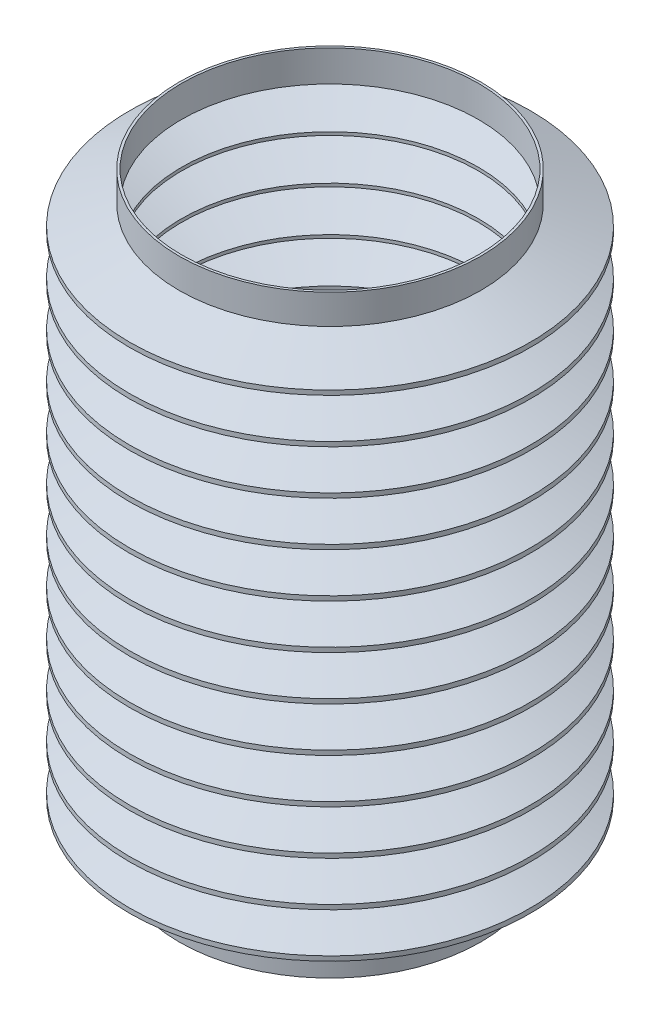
ISO-10303-21;
HEADER;
FILE_DESCRIPTION(('STEP AP214'),'2;1');
FILE_NAME('part.step','',(''),(''),'','','');
FILE_SCHEMA(('AUTOMOTIVE_DESIGN { 1 0 10303 214 1 1 1 1 }'));
ENDSEC;
DATA;
#1=APPLICATION_CONTEXT('core data for automotive mechanical design processes');
#2=APPLICATION_PROTOCOL_DEFINITION('international standard','automotive_design',2000,#1);
#3=PRODUCT_CONTEXT('',#1,'mechanical');
#4=PRODUCT('Part','Part','',(#3));
#5=PRODUCT_RELATED_PRODUCT_CATEGORY('part','',(#4));
#6=PRODUCT_DEFINITION_FORMATION('','',#4);
#7=PRODUCT_DEFINITION_CONTEXT('part definition',#1,'design');
#8=PRODUCT_DEFINITION('design','',#6,#7);
#9=PRODUCT_DEFINITION_SHAPE('','',#8);
#10=(LENGTH_UNIT() NAMED_UNIT(*) SI_UNIT(.MILLI.,.METRE.));
#11=(NAMED_UNIT(*) PLANE_ANGLE_UNIT() SI_UNIT($,.RADIAN.));
#12=(NAMED_UNIT(*) SI_UNIT($,.STERADIAN.) SOLID_ANGLE_UNIT());
#13=UNCERTAINTY_MEASURE_WITH_UNIT(LENGTH_MEASURE(1.E-05),#10,'distance_accuracy_value','');
#14=(GEOMETRIC_REPRESENTATION_CONTEXT(3) GLOBAL_UNCERTAINTY_ASSIGNED_CONTEXT((#13)) GLOBAL_UNIT_ASSIGNED_CONTEXT((#10,
#11,#12)) REPRESENTATION_CONTEXT('',''));
#15=CARTESIAN_POINT('',(0.,0.,0.));
#16=DIRECTION('',(0.,0.,1.));
#17=DIRECTION('',(1.,0.,0.));
#18=AXIS2_PLACEMENT_3D('',#15,#16,#17);
#19=CARTESIAN_POINT('',(0.,0.,0.));
#20=DIRECTION('',(0.,-1.,0.));
#21=DIRECTION('',(0.,0.,-1.));
#22=AXIS2_PLACEMENT_3D('',#19,#20,#21);
#23=CYLINDRICAL_SURFACE('',#22,63.5);
#24=CARTESIAN_POINT('',(0.,26.0863388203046,0.));
#25=DIRECTION('',(0.,-1.,0.));
#26=DIRECTION('',(0.,0.,-1.));
#27=AXIS2_PLACEMENT_3D('',#24,#25,#26);
#28=CIRCLE('',#27,63.5);
#29=CARTESIAN_POINT('',(0.,26.0863388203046,-63.5));
#30=VERTEX_POINT('',#29);
#31=EDGE_CURVE('E106',#30,#30,#28,.T.);
#32=ORIENTED_EDGE('',*,*,#31,.F.);
#33=EDGE_LOOP('',(#32));
#34=FACE_BOUND('',#33,.T.);
#35=CARTESIAN_POINT('',(0.,12.7,0.));
#36=DIRECTION('',(0.,-1.,0.));
#37=DIRECTION('',(0.,0.,-1.));
#38=AXIS2_PLACEMENT_3D('',#35,#36,#37);
#39=CIRCLE('',#38,63.5);
#40=CARTESIAN_POINT('',(0.,12.7,-63.5));
#41=VERTEX_POINT('',#40);
#42=EDGE_CURVE('E262',#41,#41,#39,.F.);
#43=ORIENTED_EDGE('',*,*,#42,.F.);
#44=EDGE_LOOP('',(#43));
#45=FACE_BOUND('',#44,.T.);
#46=ADVANCED_FACE('F32',(#34,#45),#23,.F.);
#47=CARTESIAN_POINT('',(0.,0.,0.));
#48=DIRECTION('',(0.,-1.,0.));
#49=DIRECTION('',(0.,0.,-1.));
#50=AXIS2_PLACEMENT_3D('',#47,#48,#49);
#51=CYLINDRICAL_SURFACE('',#50,64.516);
#52=CARTESIAN_POINT('',(0.,25.4,0.));
#53=DIRECTION('',(0.,-1.,0.));
#54=DIRECTION('',(0.,0.,-1.));
#55=AXIS2_PLACEMENT_3D('',#52,#53,#54);
#56=CIRCLE('',#55,64.516);
#57=CARTESIAN_POINT('',(0.,25.4,-64.516));
#58=VERTEX_POINT('',#57);
#59=EDGE_CURVE('E109',#58,#58,#56,.T.);
#60=ORIENTED_EDGE('',*,*,#59,.T.);
#61=EDGE_LOOP('',(#60));
#62=FACE_BOUND('',#61,.T.);
#63=CARTESIAN_POINT('',(0.,12.7,0.));
#64=DIRECTION('',(0.,-1.,0.));
#65=DIRECTION('',(0.,0.,-1.));
#66=AXIS2_PLACEMENT_3D('',#63,#64,#65);
#67=CIRCLE('',#66,64.516);
#68=CARTESIAN_POINT('',(0.,12.7,-64.516));
#69=VERTEX_POINT('',#68);
#70=EDGE_CURVE('E265',#69,#69,#67,.T.);
#71=ORIENTED_EDGE('',*,*,#70,.F.);
#72=EDGE_LOOP('',(#71));
#73=FACE_BOUND('',#72,.T.);
#74=ADVANCED_FACE('F272',(#62,#73),#51,.T.);
#75=CARTESIAN_POINT('',(0.,0.,0.));
#76=DIRECTION('',(0.,-1.,0.));
#77=DIRECTION('',(0.,0.,-1.));
#78=AXIS2_PLACEMENT_3D('',#75,#76,#77);
#79=CYLINDRICAL_SURFACE('',#78,64.516);
#80=CARTESIAN_POINT('',(0.,254.,0.));
#81=DIRECTION('',(0.,-1.,0.));
#82=DIRECTION('',(0.,0.,-1.));
#83=AXIS2_PLACEMENT_3D('',#80,#81,#82);
#84=CIRCLE('',#83,64.516);
#85=CARTESIAN_POINT('',(0.,254.,-64.516));
#86=VERTEX_POINT('',#85);
#87=EDGE_CURVE('E217',#86,#86,#84,.T.);
#88=ORIENTED_EDGE('',*,*,#87,.F.);
#89=EDGE_LOOP('',(#88));
#90=FACE_BOUND('',#89,.T.);
#91=CARTESIAN_POINT('',(0.,266.7,0.));
#92=DIRECTION('',(0.,-1.,0.));
#93=DIRECTION('',(0.,0.,-1.));
#94=AXIS2_PLACEMENT_3D('',#91,#92,#93);
#95=CIRCLE('',#94,64.516);
#96=CARTESIAN_POINT('',(0.,266.7,-64.516));
#97=VERTEX_POINT('',#96);
#98=EDGE_CURVE('E259',#97,#97,#95,.T.);
#99=ORIENTED_EDGE('',*,*,#98,.T.);
#100=EDGE_LOOP('',(#99));
#101=FACE_BOUND('',#100,.T.);
#102=ADVANCED_FACE('F274',(#90,#101),#79,.T.);
#103=CARTESIAN_POINT('',(0.,0.,0.));
#104=DIRECTION('',(0.,-1.,0.));
#105=DIRECTION('',(0.,0.,-1.));
#106=AXIS2_PLACEMENT_3D('',#103,#104,#105);
#107=CYLINDRICAL_SURFACE('',#106,63.5);
#108=CARTESIAN_POINT('',(0.,253.313661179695,0.));
#109=DIRECTION('',(0.,-1.,0.));
#110=DIRECTION('',(0.,0.,-1.));
#111=AXIS2_PLACEMENT_3D('',#108,#109,#110);
#112=CIRCLE('',#111,63.5);
#113=CARTESIAN_POINT('',(0.,253.313661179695,-63.5));
#114=VERTEX_POINT('',#113);
#115=EDGE_CURVE('E220',#114,#114,#112,.T.);
#116=ORIENTED_EDGE('',*,*,#115,.T.);
#117=EDGE_LOOP('',(#116));
#118=FACE_BOUND('',#117,.T.);
#119=CARTESIAN_POINT('',(0.,266.7,0.));
#120=DIRECTION('',(0.,1.,0.));
#121=DIRECTION('',(0.,0.,1.));
#122=AXIS2_PLACEMENT_3D('',#119,#120,#121);
#123=CIRCLE('',#122,63.5);
#124=CARTESIAN_POINT('',(0.,266.7,63.5));
#125=VERTEX_POINT('',#124);
#126=EDGE_CURVE('E36',#125,#125,#123,.F.);
#127=ORIENTED_EDGE('',*,*,#126,.F.);
#128=EDGE_LOOP('',(#127));
#129=FACE_BOUND('',#128,.T.);
#130=ADVANCED_FACE('F281',(#118,#129),#107,.F.);
#131=CARTESIAN_POINT('',(0.,168.275,0.));
#132=DIRECTION('',(0.,-1.,0.));
#133=DIRECTION('',(0.,0.,-1.));
#134=AXIS2_PLACEMENT_3D('',#131,#132,#133);
#135=CONICAL_SURFACE('',#134,85.4651888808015,1.18822782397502);
#136=CARTESIAN_POINT('',(0.,177.113661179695,0.));
#137=DIRECTION('',(0.,-1.,0.));
#138=DIRECTION('',(0.,0.,-1.));
#139=AXIS2_PLACEMENT_3D('',#136,#137,#138);
#140=CIRCLE('',#139,63.5);
#141=CARTESIAN_POINT('',(0.,177.113661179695,-63.5));
#142=VERTEX_POINT('',#141);
#143=EDGE_CURVE('E256',#142,#142,#140,.T.);
#144=ORIENTED_EDGE('',*,*,#143,.F.);
#145=EDGE_LOOP('',(#144));
#146=FACE_BOUND('',#145,.T.);
#147=CARTESIAN_POINT('',(0.,168.275,0.));
#148=DIRECTION('',(0.,-1.,0.));
#149=DIRECTION('',(0.,0.,-1.));
#150=AXIS2_PLACEMENT_3D('',#147,#148,#149);
#151=CIRCLE('',#150,85.4651888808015);
#152=CARTESIAN_POINT('',(0.,168.275,-85.4651888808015));
#153=VERTEX_POINT('',#152);
#154=EDGE_CURVE('E10',#153,#153,#151,.T.);
#155=ORIENTED_EDGE('',*,*,#154,.T.);
#156=EDGE_LOOP('',(#155));
#157=FACE_BOUND('',#156,.T.);
#158=ADVANCED_FACE('F34',(#146,#157),#135,.F.);
#159=CARTESIAN_POINT('',(0.,159.436338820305,0.));
#160=DIRECTION('',(0.,1.,0.));
#161=DIRECTION('',(0.,0.,1.));
#162=AXIS2_PLACEMENT_3D('',#159,#160,#161);
#163=CONICAL_SURFACE('',#162,63.5,1.18822782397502);
#164=ORIENTED_EDGE('',*,*,#154,.F.);
#165=EDGE_LOOP('',(#164));
#166=FACE_BOUND('',#165,.T.);
#167=CARTESIAN_POINT('',(0.,159.436338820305,0.));
#168=DIRECTION('',(0.,-1.,0.));
#169=DIRECTION('',(0.,0.,-1.));
#170=AXIS2_PLACEMENT_3D('',#167,#168,#169);
#171=CIRCLE('',#170,63.5);
#172=CARTESIAN_POINT('',(0.,159.436338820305,-63.5));
#173=VERTEX_POINT('',#172);
#174=EDGE_CURVE('E40',#173,#173,#171,.T.);
#175=ORIENTED_EDGE('',*,*,#174,.T.);
#176=EDGE_LOOP('',(#175));
#177=FACE_BOUND('',#176,.T.);
#178=ADVANCED_FACE('F372',(#166,#177),#163,.F.);
#179=CARTESIAN_POINT('',(0.,0.,0.));
#180=DIRECTION('',(0.,-1.,0.));
#181=DIRECTION('',(0.,0.,-1.));
#182=AXIS2_PLACEMENT_3D('',#179,#180,#181);
#183=CYLINDRICAL_SURFACE('',#182,63.5);
#184=ORIENTED_EDGE('',*,*,#174,.F.);
#185=EDGE_LOOP('',(#184));
#186=FACE_BOUND('',#185,.T.);
#187=CARTESIAN_POINT('',(0.,158.063661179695,0.));
#188=DIRECTION('',(0.,-1.,0.));
#189=DIRECTION('',(0.,0.,-1.));
#190=AXIS2_PLACEMENT_3D('',#187,#188,#189);
#191=CIRCLE('',#190,63.5);
#192=CARTESIAN_POINT('',(0.,158.063661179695,-63.5));
#193=VERTEX_POINT('',#192);
#194=EDGE_CURVE('E44',#193,#193,#191,.T.);
#195=ORIENTED_EDGE('',*,*,#194,.T.);
#196=EDGE_LOOP('',(#195));
#197=FACE_BOUND('',#196,.T.);
#198=ADVANCED_FACE('F369',(#186,#197),#183,.F.);
#199=CARTESIAN_POINT('',(0.,149.225,0.));
#200=DIRECTION('',(0.,-1.,0.));
#201=DIRECTION('',(0.,0.,-1.));
#202=AXIS2_PLACEMENT_3D('',#199,#200,#201);
#203=CONICAL_SURFACE('',#202,85.4651888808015,1.18822782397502);
#204=ORIENTED_EDGE('',*,*,#194,.F.);
#205=EDGE_LOOP('',(#204));
#206=FACE_BOUND('',#205,.T.);
#207=CARTESIAN_POINT('',(0.,149.225,0.));
#208=DIRECTION('',(0.,-1.,0.));
#209=DIRECTION('',(0.,0.,-1.));
#210=AXIS2_PLACEMENT_3D('',#207,#208,#209);
#211=CIRCLE('',#210,85.4651888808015);
#212=CARTESIAN_POINT('',(0.,149.225,-85.4651888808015));
#213=VERTEX_POINT('',#212);
#214=EDGE_CURVE('E49',#213,#213,#211,.T.);
#215=ORIENTED_EDGE('',*,*,#214,.T.);
#216=EDGE_LOOP('',(#215));
#217=FACE_BOUND('',#216,.T.);
#218=ADVANCED_FACE('F365',(#206,#217),#203,.F.);
#219=CARTESIAN_POINT('',(0.,140.386338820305,0.));
#220=DIRECTION('',(0.,1.,0.));
#221=DIRECTION('',(0.,0.,1.));
#222=AXIS2_PLACEMENT_3D('',#219,#220,#221);
#223=CONICAL_SURFACE('',#222,63.5,1.18822782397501);
#224=ORIENTED_EDGE('',*,*,#214,.F.);
#225=EDGE_LOOP('',(#224));
#226=FACE_BOUND('',#225,.T.);
#227=CARTESIAN_POINT('',(0.,140.386338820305,0.));
#228=DIRECTION('',(0.,-1.,0.));
#229=DIRECTION('',(0.,0.,-1.));
#230=AXIS2_PLACEMENT_3D('',#227,#228,#229);
#231=CIRCLE('',#230,63.5);
#232=CARTESIAN_POINT('',(0.,140.386338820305,-63.5));
#233=VERTEX_POINT('',#232);
#234=EDGE_CURVE('E52',#233,#233,#231,.T.);
#235=ORIENTED_EDGE('',*,*,#234,.T.);
#236=EDGE_LOOP('',(#235));
#237=FACE_BOUND('',#236,.T.);
#238=ADVANCED_FACE('F361',(#226,#237),#223,.F.);
#239=CARTESIAN_POINT('',(0.,0.,0.));
#240=DIRECTION('',(0.,-1.,0.));
#241=DIRECTION('',(0.,0.,-1.));
#242=AXIS2_PLACEMENT_3D('',#239,#240,#241);
#243=CYLINDRICAL_SURFACE('',#242,63.5);
#244=ORIENTED_EDGE('',*,*,#234,.F.);
#245=EDGE_LOOP('',(#244));
#246=FACE_BOUND('',#245,.T.);
#247=CARTESIAN_POINT('',(0.,139.013661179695,0.));
#248=DIRECTION('',(0.,-1.,0.));
#249=DIRECTION('',(0.,0.,-1.));
#250=AXIS2_PLACEMENT_3D('',#247,#248,#249);
#251=CIRCLE('',#250,63.5);
#252=CARTESIAN_POINT('',(0.,139.013661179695,-63.5));
#253=VERTEX_POINT('',#252);
#254=EDGE_CURVE('E55',#253,#253,#251,.T.);
#255=ORIENTED_EDGE('',*,*,#254,.T.);
#256=EDGE_LOOP('',(#255));
#257=FACE_BOUND('',#256,.T.);
#258=ADVANCED_FACE('F357',(#246,#257),#243,.F.);
#259=CARTESIAN_POINT('',(0.,130.175,0.));
#260=DIRECTION('',(0.,-1.,0.));
#261=DIRECTION('',(0.,0.,-1.));
#262=AXIS2_PLACEMENT_3D('',#259,#260,#261);
#263=CONICAL_SURFACE('',#262,85.4651888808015,1.18822782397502);
#264=ORIENTED_EDGE('',*,*,#254,.F.);
#265=EDGE_LOOP('',(#264));
#266=FACE_BOUND('',#265,.T.);
#267=CARTESIAN_POINT('',(0.,130.175,0.));
#268=DIRECTION('',(0.,-1.,0.));
#269=DIRECTION('',(0.,0.,-1.));
#270=AXIS2_PLACEMENT_3D('',#267,#268,#269);
#271=CIRCLE('',#270,85.4651888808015);
#272=CARTESIAN_POINT('',(0.,130.175,-85.4651888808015));
#273=VERTEX_POINT('',#272);
#274=EDGE_CURVE('E58',#273,#273,#271,.T.);
#275=ORIENTED_EDGE('',*,*,#274,.T.);
#276=EDGE_LOOP('',(#275));
#277=FACE_BOUND('',#276,.T.);
#278=ADVANCED_FACE('F353',(#266,#277),#263,.F.);
#279=CARTESIAN_POINT('',(0.,121.336338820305,0.));
#280=DIRECTION('',(0.,1.,0.));
#281=DIRECTION('',(0.,0.,1.));
#282=AXIS2_PLACEMENT_3D('',#279,#280,#281);
#283=CONICAL_SURFACE('',#282,63.5,1.18822782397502);
#284=ORIENTED_EDGE('',*,*,#274,.F.);
#285=EDGE_LOOP('',(#284));
#286=FACE_BOUND('',#285,.T.);
#287=CARTESIAN_POINT('',(0.,121.336338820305,0.));
#288=DIRECTION('',(0.,-1.,0.));
#289=DIRECTION('',(0.,0.,-1.));
#290=AXIS2_PLACEMENT_3D('',#287,#288,#289);
#291=CIRCLE('',#290,63.5);
#292=CARTESIAN_POINT('',(0.,121.336338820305,-63.5));
#293=VERTEX_POINT('',#292);
#294=EDGE_CURVE('E61',#293,#293,#291,.T.);
#295=ORIENTED_EDGE('',*,*,#294,.T.);
#296=EDGE_LOOP('',(#295));
#297=FACE_BOUND('',#296,.T.);
#298=ADVANCED_FACE('F349',(#286,#297),#283,.F.);
#299=CARTESIAN_POINT('',(0.,0.,0.));
#300=DIRECTION('',(0.,-1.,0.));
#301=DIRECTION('',(0.,0.,-1.));
#302=AXIS2_PLACEMENT_3D('',#299,#300,#301);
#303=CYLINDRICAL_SURFACE('',#302,63.5);
#304=ORIENTED_EDGE('',*,*,#294,.F.);
#305=EDGE_LOOP('',(#304));
#306=FACE_BOUND('',#305,.T.);
#307=CARTESIAN_POINT('',(0.,119.963661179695,0.));
#308=DIRECTION('',(0.,-1.,0.));
#309=DIRECTION('',(0.,0.,-1.));
#310=AXIS2_PLACEMENT_3D('',#307,#308,#309);
#311=CIRCLE('',#310,63.5);
#312=CARTESIAN_POINT('',(0.,119.963661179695,-63.5));
#313=VERTEX_POINT('',#312);
#314=EDGE_CURVE('E64',#313,#313,#311,.T.);
#315=ORIENTED_EDGE('',*,*,#314,.T.);
#316=EDGE_LOOP('',(#315));
#317=FACE_BOUND('',#316,.T.);
#318=ADVANCED_FACE('F345',(#306,#317),#303,.F.);
#319=CARTESIAN_POINT('',(0.,111.125,0.));
#320=DIRECTION('',(0.,-1.,0.));
#321=DIRECTION('',(0.,0.,-1.));
#322=AXIS2_PLACEMENT_3D('',#319,#320,#321);
#323=CONICAL_SURFACE('',#322,85.4651888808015,1.18822782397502);
#324=ORIENTED_EDGE('',*,*,#314,.F.);
#325=EDGE_LOOP('',(#324));
#326=FACE_BOUND('',#325,.T.);
#327=CARTESIAN_POINT('',(0.,111.125,0.));
#328=DIRECTION('',(0.,-1.,0.));
#329=DIRECTION('',(0.,0.,-1.));
#330=AXIS2_PLACEMENT_3D('',#327,#328,#329);
#331=CIRCLE('',#330,85.4651888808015);
#332=CARTESIAN_POINT('',(0.,111.125,-85.4651888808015));
#333=VERTEX_POINT('',#332);
#334=EDGE_CURVE('E67',#333,#333,#331,.T.);
#335=ORIENTED_EDGE('',*,*,#334,.T.);
#336=EDGE_LOOP('',(#335));
#337=FACE_BOUND('',#336,.T.);
#338=ADVANCED_FACE('F341',(#326,#337),#323,.F.);
#339=CARTESIAN_POINT('',(0.,102.286338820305,0.));
#340=DIRECTION('',(0.,1.,0.));
#341=DIRECTION('',(0.,0.,1.));
#342=AXIS2_PLACEMENT_3D('',#339,#340,#341);
#343=CONICAL_SURFACE('',#342,63.5,1.18822782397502);
#344=ORIENTED_EDGE('',*,*,#334,.F.);
#345=EDGE_LOOP('',(#344));
#346=FACE_BOUND('',#345,.T.);
#347=CARTESIAN_POINT('',(0.,102.286338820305,0.));
#348=DIRECTION('',(0.,-1.,0.));
#349=DIRECTION('',(0.,0.,-1.));
#350=AXIS2_PLACEMENT_3D('',#347,#348,#349);
#351=CIRCLE('',#350,63.5);
#352=CARTESIAN_POINT('',(0.,102.286338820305,-63.5));
#353=VERTEX_POINT('',#352);
#354=EDGE_CURVE('E70',#353,#353,#351,.T.);
#355=ORIENTED_EDGE('',*,*,#354,.T.);
#356=EDGE_LOOP('',(#355));
#357=FACE_BOUND('',#356,.T.);
#358=ADVANCED_FACE('F337',(#346,#357),#343,.F.);
#359=CARTESIAN_POINT('',(0.,0.,0.));
#360=DIRECTION('',(0.,-1.,0.));
#361=DIRECTION('',(0.,0.,-1.));
#362=AXIS2_PLACEMENT_3D('',#359,#360,#361);
#363=CYLINDRICAL_SURFACE('',#362,63.5);
#364=ORIENTED_EDGE('',*,*,#354,.F.);
#365=EDGE_LOOP('',(#364));
#366=FACE_BOUND('',#365,.T.);
#367=CARTESIAN_POINT('',(0.,100.913661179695,0.));
#368=DIRECTION('',(0.,-1.,0.));
#369=DIRECTION('',(0.,0.,-1.));
#370=AXIS2_PLACEMENT_3D('',#367,#368,#369);
#371=CIRCLE('',#370,63.5);
#372=CARTESIAN_POINT('',(0.,100.913661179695,-63.5));
#373=VERTEX_POINT('',#372);
#374=EDGE_CURVE('E73',#373,#373,#371,.T.);
#375=ORIENTED_EDGE('',*,*,#374,.T.);
#376=EDGE_LOOP('',(#375));
#377=FACE_BOUND('',#376,.T.);
#378=ADVANCED_FACE('F333',(#366,#377),#363,.F.);
#379=CARTESIAN_POINT('',(0.,92.0749999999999,0.));
#380=DIRECTION('',(0.,-1.,0.));
#381=DIRECTION('',(0.,0.,-1.));
#382=AXIS2_PLACEMENT_3D('',#379,#380,#381);
#383=CONICAL_SURFACE('',#382,85.4651888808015,1.18822782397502);
#384=ORIENTED_EDGE('',*,*,#374,.F.);
#385=EDGE_LOOP('',(#384));
#386=FACE_BOUND('',#385,.T.);
#387=CARTESIAN_POINT('',(0.,92.0749999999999,0.));
#388=DIRECTION('',(0.,-1.,0.));
#389=DIRECTION('',(0.,0.,-1.));
#390=AXIS2_PLACEMENT_3D('',#387,#388,#389);
#391=CIRCLE('',#390,85.4651888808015);
#392=CARTESIAN_POINT('',(0.,92.0749999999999,-85.4651888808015));
#393=VERTEX_POINT('',#392);
#394=EDGE_CURVE('E76',#393,#393,#391,.T.);
#395=ORIENTED_EDGE('',*,*,#394,.T.);
#396=EDGE_LOOP('',(#395));
#397=FACE_BOUND('',#396,.T.);
#398=ADVANCED_FACE('F329',(#386,#397),#383,.F.);
#399=CARTESIAN_POINT('',(0.,83.2363388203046,0.));
#400=DIRECTION('',(0.,1.,0.));
#401=DIRECTION('',(0.,0.,1.));
#402=AXIS2_PLACEMENT_3D('',#399,#400,#401);
#403=CONICAL_SURFACE('',#402,63.5,1.18822782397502);
#404=ORIENTED_EDGE('',*,*,#394,.F.);
#405=EDGE_LOOP('',(#404));
#406=FACE_BOUND('',#405,.T.);
#407=CARTESIAN_POINT('',(0.,83.2363388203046,0.));
#408=DIRECTION('',(0.,-1.,0.));
#409=DIRECTION('',(0.,0.,-1.));
#410=AXIS2_PLACEMENT_3D('',#407,#408,#409);
#411=CIRCLE('',#410,63.5);
#412=CARTESIAN_POINT('',(0.,83.2363388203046,-63.5));
#413=VERTEX_POINT('',#412);
#414=EDGE_CURVE('E79',#413,#413,#411,.T.);
#415=ORIENTED_EDGE('',*,*,#414,.T.);
#416=EDGE_LOOP('',(#415));
#417=FACE_BOUND('',#416,.T.);
#418=ADVANCED_FACE('F325',(#406,#417),#403,.F.);
#419=CARTESIAN_POINT('',(0.,0.,0.));
#420=DIRECTION('',(0.,-1.,0.));
#421=DIRECTION('',(0.,0.,-1.));
#422=AXIS2_PLACEMENT_3D('',#419,#420,#421);
#423=CYLINDRICAL_SURFACE('',#422,63.5);
#424=ORIENTED_EDGE('',*,*,#414,.F.);
#425=EDGE_LOOP('',(#424));
#426=FACE_BOUND('',#425,.T.);
#427=CARTESIAN_POINT('',(0.,81.8636611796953,0.));
#428=DIRECTION('',(0.,-1.,0.));
#429=DIRECTION('',(0.,0.,-1.));
#430=AXIS2_PLACEMENT_3D('',#427,#428,#429);
#431=CIRCLE('',#430,63.5);
#432=CARTESIAN_POINT('',(0.,81.8636611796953,-63.5));
#433=VERTEX_POINT('',#432);
#434=EDGE_CURVE('E82',#433,#433,#431,.T.);
#435=ORIENTED_EDGE('',*,*,#434,.T.);
#436=EDGE_LOOP('',(#435));
#437=FACE_BOUND('',#436,.T.);
#438=ADVANCED_FACE('F321',(#426,#437),#423,.F.);
#439=CARTESIAN_POINT('',(0.,73.025,0.));
#440=DIRECTION('',(0.,-1.,0.));
#441=DIRECTION('',(0.,0.,-1.));
#442=AXIS2_PLACEMENT_3D('',#439,#440,#441);
#443=CONICAL_SURFACE('',#442,85.4651888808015,1.18822782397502);
#444=ORIENTED_EDGE('',*,*,#434,.F.);
#445=EDGE_LOOP('',(#444));
#446=FACE_BOUND('',#445,.T.);
#447=CARTESIAN_POINT('',(0.,73.025,0.));
#448=DIRECTION('',(0.,-1.,0.));
#449=DIRECTION('',(0.,0.,-1.));
#450=AXIS2_PLACEMENT_3D('',#447,#448,#449);
#451=CIRCLE('',#450,85.4651888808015);
#452=CARTESIAN_POINT('',(0.,73.025,-85.4651888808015));
#453=VERTEX_POINT('',#452);
#454=EDGE_CURVE('E85',#453,#453,#451,.T.);
#455=ORIENTED_EDGE('',*,*,#454,.T.);
#456=EDGE_LOOP('',(#455));
#457=FACE_BOUND('',#456,.T.);
#458=ADVANCED_FACE('F317',(#446,#457),#443,.F.);
#459=CARTESIAN_POINT('',(0.,64.1863388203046,0.));
#460=DIRECTION('',(0.,1.,0.));
#461=DIRECTION('',(0.,0.,1.));
#462=AXIS2_PLACEMENT_3D('',#459,#460,#461);
#463=CONICAL_SURFACE('',#462,63.5,1.18822782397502);
#464=ORIENTED_EDGE('',*,*,#454,.F.);
#465=EDGE_LOOP('',(#464));
#466=FACE_BOUND('',#465,.T.);
#467=CARTESIAN_POINT('',(0.,64.1863388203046,0.));
#468=DIRECTION('',(0.,-1.,0.));
#469=DIRECTION('',(0.,0.,-1.));
#470=AXIS2_PLACEMENT_3D('',#467,#468,#469);
#471=CIRCLE('',#470,63.5);
#472=CARTESIAN_POINT('',(0.,64.1863388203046,-63.5));
#473=VERTEX_POINT('',#472);
#474=EDGE_CURVE('E88',#473,#473,#471,.T.);
#475=ORIENTED_EDGE('',*,*,#474,.T.);
#476=EDGE_LOOP('',(#475));
#477=FACE_BOUND('',#476,.T.);
#478=ADVANCED_FACE('F313',(#466,#477),#463,.F.);
#479=CARTESIAN_POINT('',(0.,0.,0.));
#480=DIRECTION('',(0.,-1.,0.));
#481=DIRECTION('',(0.,0.,-1.));
#482=AXIS2_PLACEMENT_3D('',#479,#480,#481);
#483=CYLINDRICAL_SURFACE('',#482,63.5);
#484=ORIENTED_EDGE('',*,*,#474,.F.);
#485=EDGE_LOOP('',(#484));
#486=FACE_BOUND('',#485,.T.);
#487=CARTESIAN_POINT('',(0.,62.8136611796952,0.));
#488=DIRECTION('',(0.,-1.,0.));
#489=DIRECTION('',(0.,0.,-1.));
#490=AXIS2_PLACEMENT_3D('',#487,#488,#489);
#491=CIRCLE('',#490,63.5);
#492=CARTESIAN_POINT('',(0.,62.8136611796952,-63.5));
#493=VERTEX_POINT('',#492);
#494=EDGE_CURVE('E91',#493,#493,#491,.T.);
#495=ORIENTED_EDGE('',*,*,#494,.T.);
#496=EDGE_LOOP('',(#495));
#497=FACE_BOUND('',#496,.T.);
#498=ADVANCED_FACE('F309',(#486,#497),#483,.F.);
#499=CARTESIAN_POINT('',(0.,53.9749999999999,0.));
#500=DIRECTION('',(0.,-1.,0.));
#501=DIRECTION('',(0.,0.,-1.));
#502=AXIS2_PLACEMENT_3D('',#499,#500,#501);
#503=CONICAL_SURFACE('',#502,85.4651888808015,1.18822782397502);
#504=ORIENTED_EDGE('',*,*,#494,.F.);
#505=EDGE_LOOP('',(#504));
#506=FACE_BOUND('',#505,.T.);
#507=CARTESIAN_POINT('',(0.,53.9749999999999,0.));
#508=DIRECTION('',(0.,-1.,0.));
#509=DIRECTION('',(0.,0.,-1.));
#510=AXIS2_PLACEMENT_3D('',#507,#508,#509);
#511=CIRCLE('',#510,85.4651888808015);
#512=CARTESIAN_POINT('',(0.,53.9749999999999,-85.4651888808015));
#513=VERTEX_POINT('',#512);
#514=EDGE_CURVE('E94',#513,#513,#511,.T.);
#515=ORIENTED_EDGE('',*,*,#514,.T.);
#516=EDGE_LOOP('',(#515));
#517=FACE_BOUND('',#516,.T.);
#518=ADVANCED_FACE('F305',(#506,#517),#503,.F.);
#519=CARTESIAN_POINT('',(0.,45.1363388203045,0.));
#520=DIRECTION('',(0.,1.,0.));
#521=DIRECTION('',(0.,0.,1.));
#522=AXIS2_PLACEMENT_3D('',#519,#520,#521);
#523=CONICAL_SURFACE('',#522,63.5,1.18822782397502);
#524=ORIENTED_EDGE('',*,*,#514,.F.);
#525=EDGE_LOOP('',(#524));
#526=FACE_BOUND('',#525,.T.);
#527=CARTESIAN_POINT('',(0.,45.1363388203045,0.));
#528=DIRECTION('',(0.,-1.,0.));
#529=DIRECTION('',(0.,0.,-1.));
#530=AXIS2_PLACEMENT_3D('',#527,#528,#529);
#531=CIRCLE('',#530,63.5);
#532=CARTESIAN_POINT('',(0.,45.1363388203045,-63.5));
#533=VERTEX_POINT('',#532);
#534=EDGE_CURVE('E97',#533,#533,#531,.T.);
#535=ORIENTED_EDGE('',*,*,#534,.T.);
#536=EDGE_LOOP('',(#535));
#537=FACE_BOUND('',#536,.T.);
#538=ADVANCED_FACE('F301',(#526,#537),#523,.F.);
#539=CARTESIAN_POINT('',(0.,0.,0.));
#540=DIRECTION('',(0.,-1.,0.));
#541=DIRECTION('',(0.,0.,-1.));
#542=AXIS2_PLACEMENT_3D('',#539,#540,#541);
#543=CYLINDRICAL_SURFACE('',#542,63.5);
#544=ORIENTED_EDGE('',*,*,#534,.F.);
#545=EDGE_LOOP('',(#544));
#546=FACE_BOUND('',#545,.T.);
#547=CARTESIAN_POINT('',(0.,43.7636611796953,0.));
#548=DIRECTION('',(0.,-1.,0.));
#549=DIRECTION('',(0.,0.,-1.));
#550=AXIS2_PLACEMENT_3D('',#547,#548,#549);
#551=CIRCLE('',#550,63.5);
#552=CARTESIAN_POINT('',(0.,43.7636611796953,-63.5));
#553=VERTEX_POINT('',#552);
#554=EDGE_CURVE('E100',#553,#553,#551,.T.);
#555=ORIENTED_EDGE('',*,*,#554,.T.);
#556=EDGE_LOOP('',(#555));
#557=FACE_BOUND('',#556,.T.);
#558=ADVANCED_FACE('F297',(#546,#557),#543,.F.);
#559=CARTESIAN_POINT('',(0.,34.925,0.));
#560=DIRECTION('',(0.,-1.,0.));
#561=DIRECTION('',(0.,0.,-1.));
#562=AXIS2_PLACEMENT_3D('',#559,#560,#561);
#563=CONICAL_SURFACE('',#562,85.4651888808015,1.18822782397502);
#564=ORIENTED_EDGE('',*,*,#554,.F.);
#565=EDGE_LOOP('',(#564));
#566=FACE_BOUND('',#565,.T.);
#567=CARTESIAN_POINT('',(0.,34.925,0.));
#568=DIRECTION('',(0.,-1.,0.));
#569=DIRECTION('',(0.,0.,-1.));
#570=AXIS2_PLACEMENT_3D('',#567,#568,#569);
#571=CIRCLE('',#570,85.4651888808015);
#572=CARTESIAN_POINT('',(0.,34.925,-85.4651888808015));
#573=VERTEX_POINT('',#572);
#574=EDGE_CURVE('E103',#573,#573,#571,.T.);
#575=ORIENTED_EDGE('',*,*,#574,.T.);
#576=EDGE_LOOP('',(#575));
#577=FACE_BOUND('',#576,.T.);
#578=ADVANCED_FACE('F293',(#566,#577),#563,.F.);
#579=CARTESIAN_POINT('',(0.,26.0863388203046,0.));
#580=DIRECTION('',(0.,1.,0.));
#581=DIRECTION('',(0.,0.,1.));
#582=AXIS2_PLACEMENT_3D('',#579,#580,#581);
#583=CONICAL_SURFACE('',#582,63.5,1.18822782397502);
#584=ORIENTED_EDGE('',*,*,#574,.F.);
#585=EDGE_LOOP('',(#584));
#586=FACE_BOUND('',#585,.T.);
#587=ORIENTED_EDGE('',*,*,#31,.T.);
#588=EDGE_LOOP('',(#587));
#589=FACE_BOUND('',#588,.T.);
#590=ADVANCED_FACE('F290',(#586,#589),#583,.F.);
#591=CARTESIAN_POINT('',(0.,33.9343752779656,0.));
#592=DIRECTION('',(0.,1.,0.));
#593=DIRECTION('',(0.,0.,1.));
#594=AXIS2_PLACEMENT_3D('',#591,#592,#593);
#595=CONICAL_SURFACE('',#594,85.725,1.18822782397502);
#596=ORIENTED_EDGE('',*,*,#59,.F.);
#597=EDGE_LOOP('',(#596));
#598=FACE_BOUND('',#597,.T.);
#599=CARTESIAN_POINT('',(0.,33.9343752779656,0.));
#600=DIRECTION('',(0.,-1.,0.));
#601=DIRECTION('',(0.,0.,-1.));
#602=AXIS2_PLACEMENT_3D('',#599,#600,#601);
#603=CIRCLE('',#602,85.725);
#604=CARTESIAN_POINT('',(0.,33.9343752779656,-85.725));
#605=VERTEX_POINT('',#604);
#606=EDGE_CURVE('E112',#605,#605,#603,.T.);
#607=ORIENTED_EDGE('',*,*,#606,.T.);
#608=EDGE_LOOP('',(#607));
#609=FACE_BOUND('',#608,.T.);
#610=ADVANCED_FACE('F287',(#598,#609),#595,.T.);
#611=CARTESIAN_POINT('',(0.,0.,0.));
#612=DIRECTION('',(0.,-1.,0.));
#613=DIRECTION('',(0.,0.,-1.));
#614=AXIS2_PLACEMENT_3D('',#611,#612,#613);
#615=CYLINDRICAL_SURFACE('',#614,85.725);
#616=ORIENTED_EDGE('',*,*,#606,.F.);
#617=EDGE_LOOP('',(#616));
#618=FACE_BOUND('',#617,.T.);
#619=CARTESIAN_POINT('',(0.,35.9156247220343,0.));
#620=DIRECTION('',(0.,-1.,0.));
#621=DIRECTION('',(0.,0.,-1.));
#622=AXIS2_PLACEMENT_3D('',#619,#620,#621);
#623=CIRCLE('',#622,85.725);
#624=CARTESIAN_POINT('',(0.,35.9156247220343,-85.725));
#625=VERTEX_POINT('',#624);
#626=EDGE_CURVE('E115',#625,#625,#623,.T.);
#627=ORIENTED_EDGE('',*,*,#626,.T.);
#628=EDGE_LOOP('',(#627));
#629=FACE_BOUND('',#628,.T.);
#630=ADVANCED_FACE('F620',(#618,#629),#615,.T.);
#631=CARTESIAN_POINT('',(0.,44.4499999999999,0.));
#632=DIRECTION('',(0.,-1.,0.));
#633=DIRECTION('',(0.,0.,-1.));
#634=AXIS2_PLACEMENT_3D('',#631,#632,#633);
#635=CONICAL_SURFACE('',#634,64.516,1.18822782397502);
#636=ORIENTED_EDGE('',*,*,#626,.F.);
#637=EDGE_LOOP('',(#636));
#638=FACE_BOUND('',#637,.T.);
#639=CARTESIAN_POINT('',(0.,44.4499999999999,0.));
#640=DIRECTION('',(0.,-1.,0.));
#641=DIRECTION('',(0.,0.,-1.));
#642=AXIS2_PLACEMENT_3D('',#639,#640,#641);
#643=CIRCLE('',#642,64.516);
#644=CARTESIAN_POINT('',(0.,44.4499999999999,-64.516));
#645=VERTEX_POINT('',#644);
#646=EDGE_CURVE('E118',#645,#645,#643,.T.);
#647=ORIENTED_EDGE('',*,*,#646,.T.);
#648=EDGE_LOOP('',(#647));
#649=FACE_BOUND('',#648,.T.);
#650=ADVANCED_FACE('F617',(#638,#649),#635,.T.);
#651=CARTESIAN_POINT('',(0.,52.9843752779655,0.));
#652=DIRECTION('',(0.,1.,0.));
#653=DIRECTION('',(0.,0.,1.));
#654=AXIS2_PLACEMENT_3D('',#651,#652,#653);
#655=CONICAL_SURFACE('',#654,85.725,1.18822782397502);
#656=ORIENTED_EDGE('',*,*,#646,.F.);
#657=EDGE_LOOP('',(#656));
#658=FACE_BOUND('',#657,.T.);
#659=CARTESIAN_POINT('',(0.,52.9843752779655,0.));
#660=DIRECTION('',(0.,-1.,0.));
#661=DIRECTION('',(0.,0.,-1.));
#662=AXIS2_PLACEMENT_3D('',#659,#660,#661);
#663=CIRCLE('',#662,85.725);
#664=CARTESIAN_POINT('',(0.,52.9843752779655,-85.725));
#665=VERTEX_POINT('',#664);
#666=EDGE_CURVE('E121',#665,#665,#663,.T.);
#667=ORIENTED_EDGE('',*,*,#666,.T.);
#668=EDGE_LOOP('',(#667));
#669=FACE_BOUND('',#668,.T.);
#670=ADVANCED_FACE('F613',(#658,#669),#655,.T.);
#671=CARTESIAN_POINT('',(0.,0.,0.));
#672=DIRECTION('',(0.,-1.,0.));
#673=DIRECTION('',(0.,0.,-1.));
#674=AXIS2_PLACEMENT_3D('',#671,#672,#673);
#675=CYLINDRICAL_SURFACE('',#674,85.725);
#676=ORIENTED_EDGE('',*,*,#666,.F.);
#677=EDGE_LOOP('',(#676));
#678=FACE_BOUND('',#677,.T.);
#679=CARTESIAN_POINT('',(0.,54.9656247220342,0.));
#680=DIRECTION('',(0.,-1.,0.));
#681=DIRECTION('',(0.,0.,-1.));
#682=AXIS2_PLACEMENT_3D('',#679,#680,#681);
#683=CIRCLE('',#682,85.725);
#684=CARTESIAN_POINT('',(0.,54.9656247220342,-85.725));
#685=VERTEX_POINT('',#684);
#686=EDGE_CURVE('E124',#685,#685,#683,.T.);
#687=ORIENTED_EDGE('',*,*,#686,.T.);
#688=EDGE_LOOP('',(#687));
#689=FACE_BOUND('',#688,.T.);
#690=ADVANCED_FACE('F609',(#678,#689),#675,.T.);
#691=CARTESIAN_POINT('',(0.,63.4999999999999,0.));
#692=DIRECTION('',(0.,-1.,0.));
#693=DIRECTION('',(0.,0.,-1.));
#694=AXIS2_PLACEMENT_3D('',#691,#692,#693);
#695=CONICAL_SURFACE('',#694,64.516,1.18822782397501);
#696=ORIENTED_EDGE('',*,*,#686,.F.);
#697=EDGE_LOOP('',(#696));
#698=FACE_BOUND('',#697,.T.);
#699=CARTESIAN_POINT('',(0.,63.4999999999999,0.));
#700=DIRECTION('',(0.,-1.,0.));
#701=DIRECTION('',(0.,0.,-1.));
#702=AXIS2_PLACEMENT_3D('',#699,#700,#701);
#703=CIRCLE('',#702,64.516);
#704=CARTESIAN_POINT('',(0.,63.4999999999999,-64.516));
#705=VERTEX_POINT('',#704);
#706=EDGE_CURVE('E127',#705,#705,#703,.T.);
#707=ORIENTED_EDGE('',*,*,#706,.T.);
#708=EDGE_LOOP('',(#707));
#709=FACE_BOUND('',#708,.T.);
#710=ADVANCED_FACE('F605',(#698,#709),#695,.T.);
#711=CARTESIAN_POINT('',(0.,72.0343752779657,0.));
#712=DIRECTION('',(0.,1.,0.));
#713=DIRECTION('',(0.,0.,1.));
#714=AXIS2_PLACEMENT_3D('',#711,#712,#713);
#715=CONICAL_SURFACE('',#714,85.725,1.18822782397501);
#716=ORIENTED_EDGE('',*,*,#706,.F.);
#717=EDGE_LOOP('',(#716));
#718=FACE_BOUND('',#717,.T.);
#719=CARTESIAN_POINT('',(0.,72.0343752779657,0.));
#720=DIRECTION('',(0.,-1.,0.));
#721=DIRECTION('',(0.,0.,-1.));
#722=AXIS2_PLACEMENT_3D('',#719,#720,#721);
#723=CIRCLE('',#722,85.725);
#724=CARTESIAN_POINT('',(0.,72.0343752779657,-85.725));
#725=VERTEX_POINT('',#724);
#726=EDGE_CURVE('E130',#725,#725,#723,.T.);
#727=ORIENTED_EDGE('',*,*,#726,.T.);
#728=EDGE_LOOP('',(#727));
#729=FACE_BOUND('',#728,.T.);
#730=ADVANCED_FACE('F601',(#718,#729),#715,.T.);
#731=CARTESIAN_POINT('',(0.,0.,0.));
#732=DIRECTION('',(0.,-1.,0.));
#733=DIRECTION('',(0.,0.,-1.));
#734=AXIS2_PLACEMENT_3D('',#731,#732,#733);
#735=CYLINDRICAL_SURFACE('',#734,85.725);
#736=ORIENTED_EDGE('',*,*,#726,.F.);
#737=EDGE_LOOP('',(#736));
#738=FACE_BOUND('',#737,.T.);
#739=CARTESIAN_POINT('',(0.,74.0156247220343,0.));
#740=DIRECTION('',(0.,-1.,0.));
#741=DIRECTION('',(0.,0.,-1.));
#742=AXIS2_PLACEMENT_3D('',#739,#740,#741);
#743=CIRCLE('',#742,85.725);
#744=CARTESIAN_POINT('',(0.,74.0156247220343,-85.725));
#745=VERTEX_POINT('',#744);
#746=EDGE_CURVE('E133',#745,#745,#743,.T.);
#747=ORIENTED_EDGE('',*,*,#746,.T.);
#748=EDGE_LOOP('',(#747));
#749=FACE_BOUND('',#748,.T.);
#750=ADVANCED_FACE('F597',(#738,#749),#735,.T.);
#751=CARTESIAN_POINT('',(0.,82.55,0.));
#752=DIRECTION('',(0.,-1.,0.));
#753=DIRECTION('',(0.,0.,-1.));
#754=AXIS2_PLACEMENT_3D('',#751,#752,#753);
#755=CONICAL_SURFACE('',#754,64.516,1.18822782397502);
#756=ORIENTED_EDGE('',*,*,#746,.F.);
#757=EDGE_LOOP('',(#756));
#758=FACE_BOUND('',#757,.T.);
#759=CARTESIAN_POINT('',(0.,82.55,0.));
#760=DIRECTION('',(0.,-1.,0.));
#761=DIRECTION('',(0.,0.,-1.));
#762=AXIS2_PLACEMENT_3D('',#759,#760,#761);
#763=CIRCLE('',#762,64.516);
#764=CARTESIAN_POINT('',(0.,82.55,-64.516));
#765=VERTEX_POINT('',#764);
#766=EDGE_CURVE('E136',#765,#765,#763,.T.);
#767=ORIENTED_EDGE('',*,*,#766,.T.);
#768=EDGE_LOOP('',(#767));
#769=FACE_BOUND('',#768,.T.);
#770=ADVANCED_FACE('F593',(#758,#769),#755,.T.);
#771=CARTESIAN_POINT('',(0.,91.0843752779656,0.));
#772=DIRECTION('',(0.,1.,0.));
#773=DIRECTION('',(0.,0.,1.));
#774=AXIS2_PLACEMENT_3D('',#771,#772,#773);
#775=CONICAL_SURFACE('',#774,85.725,1.18822782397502);
#776=ORIENTED_EDGE('',*,*,#766,.F.);
#777=EDGE_LOOP('',(#776));
#778=FACE_BOUND('',#777,.T.);
#779=CARTESIAN_POINT('',(0.,91.0843752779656,0.));
#780=DIRECTION('',(0.,-1.,0.));
#781=DIRECTION('',(0.,0.,-1.));
#782=AXIS2_PLACEMENT_3D('',#779,#780,#781);
#783=CIRCLE('',#782,85.725);
#784=CARTESIAN_POINT('',(0.,91.0843752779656,-85.725));
#785=VERTEX_POINT('',#784);
#786=EDGE_CURVE('E139',#785,#785,#783,.T.);
#787=ORIENTED_EDGE('',*,*,#786,.T.);
#788=EDGE_LOOP('',(#787));
#789=FACE_BOUND('',#788,.T.);
#790=ADVANCED_FACE('F589',(#778,#789),#775,.T.);
#791=CARTESIAN_POINT('',(0.,0.,0.));
#792=DIRECTION('',(0.,-1.,0.));
#793=DIRECTION('',(0.,0.,-1.));
#794=AXIS2_PLACEMENT_3D('',#791,#792,#793);
#795=CYLINDRICAL_SURFACE('',#794,85.725);
#796=ORIENTED_EDGE('',*,*,#786,.F.);
#797=EDGE_LOOP('',(#796));
#798=FACE_BOUND('',#797,.T.);
#799=CARTESIAN_POINT('',(0.,93.0656247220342,0.));
#800=DIRECTION('',(0.,-1.,0.));
#801=DIRECTION('',(0.,0.,-1.));
#802=AXIS2_PLACEMENT_3D('',#799,#800,#801);
#803=CIRCLE('',#802,85.725);
#804=CARTESIAN_POINT('',(0.,93.0656247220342,-85.725));
#805=VERTEX_POINT('',#804);
#806=EDGE_CURVE('E142',#805,#805,#803,.T.);
#807=ORIENTED_EDGE('',*,*,#806,.T.);
#808=EDGE_LOOP('',(#807));
#809=FACE_BOUND('',#808,.T.);
#810=ADVANCED_FACE('F585',(#798,#809),#795,.T.);
#811=CARTESIAN_POINT('',(0.,101.6,0.));
#812=DIRECTION('',(0.,-1.,0.));
#813=DIRECTION('',(0.,0.,-1.));
#814=AXIS2_PLACEMENT_3D('',#811,#812,#813);
#815=CONICAL_SURFACE('',#814,64.516,1.18822782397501);
#816=ORIENTED_EDGE('',*,*,#806,.F.);
#817=EDGE_LOOP('',(#816));
#818=FACE_BOUND('',#817,.T.);
#819=CARTESIAN_POINT('',(0.,101.6,0.));
#820=DIRECTION('',(0.,-1.,0.));
#821=DIRECTION('',(0.,0.,-1.));
#822=AXIS2_PLACEMENT_3D('',#819,#820,#821);
#823=CIRCLE('',#822,64.516);
#824=CARTESIAN_POINT('',(0.,101.6,-64.516));
#825=VERTEX_POINT('',#824);
#826=EDGE_CURVE('E145',#825,#825,#823,.T.);
#827=ORIENTED_EDGE('',*,*,#826,.T.);
#828=EDGE_LOOP('',(#827));
#829=FACE_BOUND('',#828,.T.);
#830=ADVANCED_FACE('F581',(#818,#829),#815,.T.);
#831=CARTESIAN_POINT('',(0.,110.134375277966,0.));
#832=DIRECTION('',(0.,1.,0.));
#833=DIRECTION('',(0.,0.,1.));
#834=AXIS2_PLACEMENT_3D('',#831,#832,#833);
#835=CONICAL_SURFACE('',#834,85.725,1.18822782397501);
#836=ORIENTED_EDGE('',*,*,#826,.F.);
#837=EDGE_LOOP('',(#836));
#838=FACE_BOUND('',#837,.T.);
#839=CARTESIAN_POINT('',(0.,110.134375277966,0.));
#840=DIRECTION('',(0.,-1.,0.));
#841=DIRECTION('',(0.,0.,-1.));
#842=AXIS2_PLACEMENT_3D('',#839,#840,#841);
#843=CIRCLE('',#842,85.725);
#844=CARTESIAN_POINT('',(0.,110.134375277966,-85.725));
#845=VERTEX_POINT('',#844);
#846=EDGE_CURVE('E148',#845,#845,#843,.T.);
#847=ORIENTED_EDGE('',*,*,#846,.T.);
#848=EDGE_LOOP('',(#847));
#849=FACE_BOUND('',#848,.T.);
#850=ADVANCED_FACE('F577',(#838,#849),#835,.T.);
#851=CARTESIAN_POINT('',(0.,0.,0.));
#852=DIRECTION('',(0.,-1.,0.));
#853=DIRECTION('',(0.,0.,-1.));
#854=AXIS2_PLACEMENT_3D('',#851,#852,#853);
#855=CYLINDRICAL_SURFACE('',#854,85.725);
#856=ORIENTED_EDGE('',*,*,#846,.F.);
#857=EDGE_LOOP('',(#856));
#858=FACE_BOUND('',#857,.T.);
#859=CARTESIAN_POINT('',(0.,112.115624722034,0.));
#860=DIRECTION('',(0.,-1.,0.));
#861=DIRECTION('',(0.,0.,-1.));
#862=AXIS2_PLACEMENT_3D('',#859,#860,#861);
#863=CIRCLE('',#862,85.725);
#864=CARTESIAN_POINT('',(0.,112.115624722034,-85.725));
#865=VERTEX_POINT('',#864);
#866=EDGE_CURVE('E151',#865,#865,#863,.T.);
#867=ORIENTED_EDGE('',*,*,#866,.T.);
#868=EDGE_LOOP('',(#867));
#869=FACE_BOUND('',#868,.T.);
#870=ADVANCED_FACE('F573',(#858,#869),#855,.T.);
#871=CARTESIAN_POINT('',(0.,120.65,0.));
#872=DIRECTION('',(0.,-1.,0.));
#873=DIRECTION('',(0.,0.,-1.));
#874=AXIS2_PLACEMENT_3D('',#871,#872,#873);
#875=CONICAL_SURFACE('',#874,64.516,1.18822782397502);
#876=ORIENTED_EDGE('',*,*,#866,.F.);
#877=EDGE_LOOP('',(#876));
#878=FACE_BOUND('',#877,.T.);
#879=CARTESIAN_POINT('',(0.,120.65,0.));
#880=DIRECTION('',(0.,-1.,0.));
#881=DIRECTION('',(0.,0.,-1.));
#882=AXIS2_PLACEMENT_3D('',#879,#880,#881);
#883=CIRCLE('',#882,64.516);
#884=CARTESIAN_POINT('',(0.,120.65,-64.516));
#885=VERTEX_POINT('',#884);
#886=EDGE_CURVE('E154',#885,#885,#883,.T.);
#887=ORIENTED_EDGE('',*,*,#886,.T.);
#888=EDGE_LOOP('',(#887));
#889=FACE_BOUND('',#888,.T.);
#890=ADVANCED_FACE('F569',(#878,#889),#875,.T.);
#891=CARTESIAN_POINT('',(0.,129.184375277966,0.));
#892=DIRECTION('',(0.,1.,0.));
#893=DIRECTION('',(0.,0.,1.));
#894=AXIS2_PLACEMENT_3D('',#891,#892,#893);
#895=CONICAL_SURFACE('',#894,85.725,1.18822782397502);
#896=ORIENTED_EDGE('',*,*,#886,.F.);
#897=EDGE_LOOP('',(#896));
#898=FACE_BOUND('',#897,.T.);
#899=CARTESIAN_POINT('',(0.,129.184375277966,0.));
#900=DIRECTION('',(0.,-1.,0.));
#901=DIRECTION('',(0.,0.,-1.));
#902=AXIS2_PLACEMENT_3D('',#899,#900,#901);
#903=CIRCLE('',#902,85.725);
#904=CARTESIAN_POINT('',(0.,129.184375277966,-85.725));
#905=VERTEX_POINT('',#904);
#906=EDGE_CURVE('E157',#905,#905,#903,.T.);
#907=ORIENTED_EDGE('',*,*,#906,.T.);
#908=EDGE_LOOP('',(#907));
#909=FACE_BOUND('',#908,.T.);
#910=ADVANCED_FACE('F565',(#898,#909),#895,.T.);
#911=CARTESIAN_POINT('',(0.,0.,0.));
#912=DIRECTION('',(0.,-1.,0.));
#913=DIRECTION('',(0.,0.,-1.));
#914=AXIS2_PLACEMENT_3D('',#911,#912,#913);
#915=CYLINDRICAL_SURFACE('',#914,85.725);
#916=ORIENTED_EDGE('',*,*,#906,.F.);
#917=EDGE_LOOP('',(#916));
#918=FACE_BOUND('',#917,.T.);
#919=CARTESIAN_POINT('',(0.,131.165624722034,0.));
#920=DIRECTION('',(0.,-1.,0.));
#921=DIRECTION('',(0.,0.,-1.));
#922=AXIS2_PLACEMENT_3D('',#919,#920,#921);
#923=CIRCLE('',#922,85.725);
#924=CARTESIAN_POINT('',(0.,131.165624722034,-85.725));
#925=VERTEX_POINT('',#924);
#926=EDGE_CURVE('E160',#925,#925,#923,.T.);
#927=ORIENTED_EDGE('',*,*,#926,.T.);
#928=EDGE_LOOP('',(#927));
#929=FACE_BOUND('',#928,.T.);
#930=ADVANCED_FACE('F561',(#918,#929),#915,.T.);
#931=CARTESIAN_POINT('',(0.,139.7,0.));
#932=DIRECTION('',(0.,-1.,0.));
#933=DIRECTION('',(0.,0.,-1.));
#934=AXIS2_PLACEMENT_3D('',#931,#932,#933);
#935=CONICAL_SURFACE('',#934,64.516,1.18822782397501);
#936=ORIENTED_EDGE('',*,*,#926,.F.);
#937=EDGE_LOOP('',(#936));
#938=FACE_BOUND('',#937,.T.);
#939=CARTESIAN_POINT('',(0.,139.7,0.));
#940=DIRECTION('',(0.,-1.,0.));
#941=DIRECTION('',(0.,0.,-1.));
#942=AXIS2_PLACEMENT_3D('',#939,#940,#941);
#943=CIRCLE('',#942,64.516);
#944=CARTESIAN_POINT('',(0.,139.7,-64.516));
#945=VERTEX_POINT('',#944);
#946=EDGE_CURVE('E163',#945,#945,#943,.T.);
#947=ORIENTED_EDGE('',*,*,#946,.T.);
#948=EDGE_LOOP('',(#947));
#949=FACE_BOUND('',#948,.T.);
#950=ADVANCED_FACE('F557',(#938,#949),#935,.T.);
#951=CARTESIAN_POINT('',(0.,148.234375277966,0.));
#952=DIRECTION('',(0.,1.,0.));
#953=DIRECTION('',(0.,0.,1.));
#954=AXIS2_PLACEMENT_3D('',#951,#952,#953);
#955=CONICAL_SURFACE('',#954,85.725,1.18822782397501);
#956=ORIENTED_EDGE('',*,*,#946,.F.);
#957=EDGE_LOOP('',(#956));
#958=FACE_BOUND('',#957,.T.);
#959=CARTESIAN_POINT('',(0.,148.234375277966,0.));
#960=DIRECTION('',(0.,-1.,0.));
#961=DIRECTION('',(0.,0.,-1.));
#962=AXIS2_PLACEMENT_3D('',#959,#960,#961);
#963=CIRCLE('',#962,85.725);
#964=CARTESIAN_POINT('',(0.,148.234375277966,-85.725));
#965=VERTEX_POINT('',#964);
#966=EDGE_CURVE('E166',#965,#965,#963,.T.);
#967=ORIENTED_EDGE('',*,*,#966,.T.);
#968=EDGE_LOOP('',(#967));
#969=FACE_BOUND('',#968,.T.);
#970=ADVANCED_FACE('F553',(#958,#969),#955,.T.);
#971=CARTESIAN_POINT('',(0.,0.,0.));
#972=DIRECTION('',(0.,-1.,0.));
#973=DIRECTION('',(0.,0.,-1.));
#974=AXIS2_PLACEMENT_3D('',#971,#972,#973);
#975=CYLINDRICAL_SURFACE('',#974,85.725);
#976=ORIENTED_EDGE('',*,*,#966,.F.);
#977=EDGE_LOOP('',(#976));
#978=FACE_BOUND('',#977,.T.);
#979=CARTESIAN_POINT('',(0.,150.215624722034,0.));
#980=DIRECTION('',(0.,-1.,0.));
#981=DIRECTION('',(0.,0.,-1.));
#982=AXIS2_PLACEMENT_3D('',#979,#980,#981);
#983=CIRCLE('',#982,85.725);
#984=CARTESIAN_POINT('',(0.,150.215624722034,-85.725));
#985=VERTEX_POINT('',#984);
#986=EDGE_CURVE('E169',#985,#985,#983,.T.);
#987=ORIENTED_EDGE('',*,*,#986,.T.);
#988=EDGE_LOOP('',(#987));
#989=FACE_BOUND('',#988,.T.);
#990=ADVANCED_FACE('F549',(#978,#989),#975,.T.);
#991=CARTESIAN_POINT('',(0.,158.75,0.));
#992=DIRECTION('',(0.,-1.,0.));
#993=DIRECTION('',(0.,0.,-1.));
#994=AXIS2_PLACEMENT_3D('',#991,#992,#993);
#995=CONICAL_SURFACE('',#994,64.516,1.18822782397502);
#996=ORIENTED_EDGE('',*,*,#986,.F.);
#997=EDGE_LOOP('',(#996));
#998=FACE_BOUND('',#997,.T.);
#999=CARTESIAN_POINT('',(0.,158.75,0.));
#1000=DIRECTION('',(0.,-1.,0.));
#1001=DIRECTION('',(0.,0.,-1.));
#1002=AXIS2_PLACEMENT_3D('',#999,#1000,#1001);
#1003=CIRCLE('',#1002,64.516);
#1004=CARTESIAN_POINT('',(0.,158.75,-64.516));
#1005=VERTEX_POINT('',#1004);
#1006=EDGE_CURVE('E172',#1005,#1005,#1003,.T.);
#1007=ORIENTED_EDGE('',*,*,#1006,.T.);
#1008=EDGE_LOOP('',(#1007));
#1009=FACE_BOUND('',#1008,.T.);
#1010=ADVANCED_FACE('F545',(#998,#1009),#995,.T.);
#1011=CARTESIAN_POINT('',(0.,167.284375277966,0.));
#1012=DIRECTION('',(0.,1.,0.));
#1013=DIRECTION('',(0.,0.,1.));
#1014=AXIS2_PLACEMENT_3D('',#1011,#1012,#1013);
#1015=CONICAL_SURFACE('',#1014,85.725,1.18822782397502);
#1016=ORIENTED_EDGE('',*,*,#1006,.F.);
#1017=EDGE_LOOP('',(#1016));
#1018=FACE_BOUND('',#1017,.T.);
#1019=CARTESIAN_POINT('',(0.,167.284375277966,0.));
#1020=DIRECTION('',(0.,-1.,0.));
#1021=DIRECTION('',(0.,0.,-1.));
#1022=AXIS2_PLACEMENT_3D('',#1019,#1020,#1021);
#1023=CIRCLE('',#1022,85.725);
#1024=CARTESIAN_POINT('',(0.,167.284375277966,-85.725));
#1025=VERTEX_POINT('',#1024);
#1026=EDGE_CURVE('E175',#1025,#1025,#1023,.T.);
#1027=ORIENTED_EDGE('',*,*,#1026,.T.);
#1028=EDGE_LOOP('',(#1027));
#1029=FACE_BOUND('',#1028,.T.);
#1030=ADVANCED_FACE('F541',(#1018,#1029),#1015,.T.);
#1031=CARTESIAN_POINT('',(0.,0.,0.));
#1032=DIRECTION('',(0.,-1.,0.));
#1033=DIRECTION('',(0.,0.,-1.));
#1034=AXIS2_PLACEMENT_3D('',#1031,#1032,#1033);
#1035=CYLINDRICAL_SURFACE('',#1034,85.725);
#1036=ORIENTED_EDGE('',*,*,#1026,.F.);
#1037=EDGE_LOOP('',(#1036));
#1038=FACE_BOUND('',#1037,.T.);
#1039=CARTESIAN_POINT('',(0.,169.265624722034,0.));
#1040=DIRECTION('',(0.,-1.,0.));
#1041=DIRECTION('',(0.,0.,-1.));
#1042=AXIS2_PLACEMENT_3D('',#1039,#1040,#1041);
#1043=CIRCLE('',#1042,85.725);
#1044=CARTESIAN_POINT('',(0.,169.265624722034,-85.725));
#1045=VERTEX_POINT('',#1044);
#1046=EDGE_CURVE('E178',#1045,#1045,#1043,.T.);
#1047=ORIENTED_EDGE('',*,*,#1046,.T.);
#1048=EDGE_LOOP('',(#1047));
#1049=FACE_BOUND('',#1048,.T.);
#1050=ADVANCED_FACE('F537',(#1038,#1049),#1035,.T.);
#1051=CARTESIAN_POINT('',(0.,177.8,0.));
#1052=DIRECTION('',(0.,-1.,0.));
#1053=DIRECTION('',(0.,0.,-1.));
#1054=AXIS2_PLACEMENT_3D('',#1051,#1052,#1053);
#1055=CONICAL_SURFACE('',#1054,64.516,1.18822782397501);
#1056=ORIENTED_EDGE('',*,*,#1046,.F.);
#1057=EDGE_LOOP('',(#1056));
#1058=FACE_BOUND('',#1057,.T.);
#1059=CARTESIAN_POINT('',(0.,177.8,0.));
#1060=DIRECTION('',(0.,-1.,0.));
#1061=DIRECTION('',(0.,0.,-1.));
#1062=AXIS2_PLACEMENT_3D('',#1059,#1060,#1061);
#1063=CIRCLE('',#1062,64.516);
#1064=CARTESIAN_POINT('',(0.,177.8,-64.516));
#1065=VERTEX_POINT('',#1064);
#1066=EDGE_CURVE('E181',#1065,#1065,#1063,.T.);
#1067=ORIENTED_EDGE('',*,*,#1066,.T.);
#1068=EDGE_LOOP('',(#1067));
#1069=FACE_BOUND('',#1068,.T.);
#1070=ADVANCED_FACE('F533',(#1058,#1069),#1055,.T.);
#1071=CARTESIAN_POINT('',(0.,186.334375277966,0.));
#1072=DIRECTION('',(0.,1.,0.));
#1073=DIRECTION('',(0.,0.,1.));
#1074=AXIS2_PLACEMENT_3D('',#1071,#1072,#1073);
#1075=CONICAL_SURFACE('',#1074,85.725,1.18822782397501);
#1076=ORIENTED_EDGE('',*,*,#1066,.F.);
#1077=EDGE_LOOP('',(#1076));
#1078=FACE_BOUND('',#1077,.T.);
#1079=CARTESIAN_POINT('',(0.,186.334375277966,0.));
#1080=DIRECTION('',(0.,-1.,0.));
#1081=DIRECTION('',(0.,0.,-1.));
#1082=AXIS2_PLACEMENT_3D('',#1079,#1080,#1081);
#1083=CIRCLE('',#1082,85.725);
#1084=CARTESIAN_POINT('',(0.,186.334375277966,-85.725));
#1085=VERTEX_POINT('',#1084);
#1086=EDGE_CURVE('E184',#1085,#1085,#1083,.T.);
#1087=ORIENTED_EDGE('',*,*,#1086,.T.);
#1088=EDGE_LOOP('',(#1087));
#1089=FACE_BOUND('',#1088,.T.);
#1090=ADVANCED_FACE('F529',(#1078,#1089),#1075,.T.);
#1091=CARTESIAN_POINT('',(0.,0.,0.));
#1092=DIRECTION('',(0.,-1.,0.));
#1093=DIRECTION('',(0.,0.,-1.));
#1094=AXIS2_PLACEMENT_3D('',#1091,#1092,#1093);
#1095=CYLINDRICAL_SURFACE('',#1094,85.725);
#1096=ORIENTED_EDGE('',*,*,#1086,.F.);
#1097=EDGE_LOOP('',(#1096));
#1098=FACE_BOUND('',#1097,.T.);
#1099=CARTESIAN_POINT('',(0.,188.315624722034,0.));
#1100=DIRECTION('',(0.,-1.,0.));
#1101=DIRECTION('',(0.,0.,-1.));
#1102=AXIS2_PLACEMENT_3D('',#1099,#1100,#1101);
#1103=CIRCLE('',#1102,85.725);
#1104=CARTESIAN_POINT('',(0.,188.315624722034,-85.725));
#1105=VERTEX_POINT('',#1104);
#1106=EDGE_CURVE('E187',#1105,#1105,#1103,.T.);
#1107=ORIENTED_EDGE('',*,*,#1106,.T.);
#1108=EDGE_LOOP('',(#1107));
#1109=FACE_BOUND('',#1108,.T.);
#1110=ADVANCED_FACE('F525',(#1098,#1109),#1095,.T.);
#1111=CARTESIAN_POINT('',(0.,196.85,0.));
#1112=DIRECTION('',(0.,-1.,0.));
#1113=DIRECTION('',(0.,0.,-1.));
#1114=AXIS2_PLACEMENT_3D('',#1111,#1112,#1113);
#1115=CONICAL_SURFACE('',#1114,64.516,1.18822782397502);
#1116=ORIENTED_EDGE('',*,*,#1106,.F.);
#1117=EDGE_LOOP('',(#1116));
#1118=FACE_BOUND('',#1117,.T.);
#1119=CARTESIAN_POINT('',(0.,196.85,0.));
#1120=DIRECTION('',(0.,-1.,0.));
#1121=DIRECTION('',(0.,0.,-1.));
#1122=AXIS2_PLACEMENT_3D('',#1119,#1120,#1121);
#1123=CIRCLE('',#1122,64.516);
#1124=CARTESIAN_POINT('',(0.,196.85,-64.516));
#1125=VERTEX_POINT('',#1124);
#1126=EDGE_CURVE('E190',#1125,#1125,#1123,.T.);
#1127=ORIENTED_EDGE('',*,*,#1126,.T.);
#1128=EDGE_LOOP('',(#1127));
#1129=FACE_BOUND('',#1128,.T.);
#1130=ADVANCED_FACE('F521',(#1118,#1129),#1115,.T.);
#1131=CARTESIAN_POINT('',(0.,205.384375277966,0.));
#1132=DIRECTION('',(0.,1.,0.));
#1133=DIRECTION('',(0.,0.,1.));
#1134=AXIS2_PLACEMENT_3D('',#1131,#1132,#1133);
#1135=CONICAL_SURFACE('',#1134,85.725,1.18822782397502);
#1136=ORIENTED_EDGE('',*,*,#1126,.F.);
#1137=EDGE_LOOP('',(#1136));
#1138=FACE_BOUND('',#1137,.T.);
#1139=CARTESIAN_POINT('',(0.,205.384375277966,0.));
#1140=DIRECTION('',(0.,-1.,0.));
#1141=DIRECTION('',(0.,0.,-1.));
#1142=AXIS2_PLACEMENT_3D('',#1139,#1140,#1141);
#1143=CIRCLE('',#1142,85.725);
#1144=CARTESIAN_POINT('',(0.,205.384375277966,-85.725));
#1145=VERTEX_POINT('',#1144);
#1146=EDGE_CURVE('E193',#1145,#1145,#1143,.T.);
#1147=ORIENTED_EDGE('',*,*,#1146,.T.);
#1148=EDGE_LOOP('',(#1147));
#1149=FACE_BOUND('',#1148,.T.);
#1150=ADVANCED_FACE('F517',(#1138,#1149),#1135,.T.);
#1151=CARTESIAN_POINT('',(0.,0.,0.));
#1152=DIRECTION('',(0.,-1.,0.));
#1153=DIRECTION('',(0.,0.,-1.));
#1154=AXIS2_PLACEMENT_3D('',#1151,#1152,#1153);
#1155=CYLINDRICAL_SURFACE('',#1154,85.725);
#1156=ORIENTED_EDGE('',*,*,#1146,.F.);
#1157=EDGE_LOOP('',(#1156));
#1158=FACE_BOUND('',#1157,.T.);
#1159=CARTESIAN_POINT('',(0.,207.365624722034,0.));
#1160=DIRECTION('',(0.,-1.,0.));
#1161=DIRECTION('',(0.,0.,-1.));
#1162=AXIS2_PLACEMENT_3D('',#1159,#1160,#1161);
#1163=CIRCLE('',#1162,85.725);
#1164=CARTESIAN_POINT('',(0.,207.365624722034,-85.725));
#1165=VERTEX_POINT('',#1164);
#1166=EDGE_CURVE('E196',#1165,#1165,#1163,.T.);
#1167=ORIENTED_EDGE('',*,*,#1166,.T.);
#1168=EDGE_LOOP('',(#1167));
#1169=FACE_BOUND('',#1168,.T.);
#1170=ADVANCED_FACE('F513',(#1158,#1169),#1155,.T.);
#1171=CARTESIAN_POINT('',(0.,215.9,0.));
#1172=DIRECTION('',(0.,-1.,0.));
#1173=DIRECTION('',(0.,0.,-1.));
#1174=AXIS2_PLACEMENT_3D('',#1171,#1172,#1173);
#1175=CONICAL_SURFACE('',#1174,64.516,1.18822782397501);
#1176=ORIENTED_EDGE('',*,*,#1166,.F.);
#1177=EDGE_LOOP('',(#1176));
#1178=FACE_BOUND('',#1177,.T.);
#1179=CARTESIAN_POINT('',(0.,215.9,0.));
#1180=DIRECTION('',(0.,-1.,0.));
#1181=DIRECTION('',(0.,0.,-1.));
#1182=AXIS2_PLACEMENT_3D('',#1179,#1180,#1181);
#1183=CIRCLE('',#1182,64.516);
#1184=CARTESIAN_POINT('',(0.,215.9,-64.516));
#1185=VERTEX_POINT('',#1184);
#1186=EDGE_CURVE('E199',#1185,#1185,#1183,.T.);
#1187=ORIENTED_EDGE('',*,*,#1186,.T.);
#1188=EDGE_LOOP('',(#1187));
#1189=FACE_BOUND('',#1188,.T.);
#1190=ADVANCED_FACE('F509',(#1178,#1189),#1175,.T.);
#1191=CARTESIAN_POINT('',(0.,224.434375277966,0.));
#1192=DIRECTION('',(0.,1.,0.));
#1193=DIRECTION('',(0.,0.,1.));
#1194=AXIS2_PLACEMENT_3D('',#1191,#1192,#1193);
#1195=CONICAL_SURFACE('',#1194,85.725,1.18822782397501);
#1196=ORIENTED_EDGE('',*,*,#1186,.F.);
#1197=EDGE_LOOP('',(#1196));
#1198=FACE_BOUND('',#1197,.T.);
#1199=CARTESIAN_POINT('',(0.,224.434375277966,0.));
#1200=DIRECTION('',(0.,-1.,0.));
#1201=DIRECTION('',(0.,0.,-1.));
#1202=AXIS2_PLACEMENT_3D('',#1199,#1200,#1201);
#1203=CIRCLE('',#1202,85.725);
#1204=CARTESIAN_POINT('',(0.,224.434375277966,-85.725));
#1205=VERTEX_POINT('',#1204);
#1206=EDGE_CURVE('E202',#1205,#1205,#1203,.T.);
#1207=ORIENTED_EDGE('',*,*,#1206,.T.);
#1208=EDGE_LOOP('',(#1207));
#1209=FACE_BOUND('',#1208,.T.);
#1210=ADVANCED_FACE('F505',(#1198,#1209),#1195,.T.);
#1211=CARTESIAN_POINT('',(0.,0.,0.));
#1212=DIRECTION('',(0.,-1.,0.));
#1213=DIRECTION('',(0.,0.,-1.));
#1214=AXIS2_PLACEMENT_3D('',#1211,#1212,#1213);
#1215=CYLINDRICAL_SURFACE('',#1214,85.725);
#1216=ORIENTED_EDGE('',*,*,#1206,.F.);
#1217=EDGE_LOOP('',(#1216));
#1218=FACE_BOUND('',#1217,.T.);
#1219=CARTESIAN_POINT('',(0.,226.415624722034,0.));
#1220=DIRECTION('',(0.,-1.,0.));
#1221=DIRECTION('',(0.,0.,-1.));
#1222=AXIS2_PLACEMENT_3D('',#1219,#1220,#1221);
#1223=CIRCLE('',#1222,85.725);
#1224=CARTESIAN_POINT('',(0.,226.415624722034,-85.725));
#1225=VERTEX_POINT('',#1224);
#1226=EDGE_CURVE('E205',#1225,#1225,#1223,.T.);
#1227=ORIENTED_EDGE('',*,*,#1226,.T.);
#1228=EDGE_LOOP('',(#1227));
#1229=FACE_BOUND('',#1228,.T.);
#1230=ADVANCED_FACE('F501',(#1218,#1229),#1215,.T.);
#1231=CARTESIAN_POINT('',(0.,234.95,0.));
#1232=DIRECTION('',(0.,-1.,0.));
#1233=DIRECTION('',(0.,0.,-1.));
#1234=AXIS2_PLACEMENT_3D('',#1231,#1232,#1233);
#1235=CONICAL_SURFACE('',#1234,64.516,1.18822782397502);
#1236=ORIENTED_EDGE('',*,*,#1226,.F.);
#1237=EDGE_LOOP('',(#1236));
#1238=FACE_BOUND('',#1237,.T.);
#1239=CARTESIAN_POINT('',(0.,234.95,0.));
#1240=DIRECTION('',(0.,-1.,0.));
#1241=DIRECTION('',(0.,0.,-1.));
#1242=AXIS2_PLACEMENT_3D('',#1239,#1240,#1241);
#1243=CIRCLE('',#1242,64.516);
#1244=CARTESIAN_POINT('',(0.,234.95,-64.516));
#1245=VERTEX_POINT('',#1244);
#1246=EDGE_CURVE('E208',#1245,#1245,#1243,.T.);
#1247=ORIENTED_EDGE('',*,*,#1246,.T.);
#1248=EDGE_LOOP('',(#1247));
#1249=FACE_BOUND('',#1248,.T.);
#1250=ADVANCED_FACE('F497',(#1238,#1249),#1235,.T.);
#1251=CARTESIAN_POINT('',(0.,243.484375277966,0.));
#1252=DIRECTION('',(0.,1.,0.));
#1253=DIRECTION('',(0.,0.,1.));
#1254=AXIS2_PLACEMENT_3D('',#1251,#1252,#1253);
#1255=CONICAL_SURFACE('',#1254,85.725,1.18822782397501);
#1256=ORIENTED_EDGE('',*,*,#1246,.F.);
#1257=EDGE_LOOP('',(#1256));
#1258=FACE_BOUND('',#1257,.T.);
#1259=CARTESIAN_POINT('',(0.,243.484375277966,0.));
#1260=DIRECTION('',(0.,-1.,0.));
#1261=DIRECTION('',(0.,0.,-1.));
#1262=AXIS2_PLACEMENT_3D('',#1259,#1260,#1261);
#1263=CIRCLE('',#1262,85.725);
#1264=CARTESIAN_POINT('',(0.,243.484375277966,-85.725));
#1265=VERTEX_POINT('',#1264);
#1266=EDGE_CURVE('E211',#1265,#1265,#1263,.T.);
#1267=ORIENTED_EDGE('',*,*,#1266,.T.);
#1268=EDGE_LOOP('',(#1267));
#1269=FACE_BOUND('',#1268,.T.);
#1270=ADVANCED_FACE('F493',(#1258,#1269),#1255,.T.);
#1271=CARTESIAN_POINT('',(0.,0.,0.));
#1272=DIRECTION('',(0.,-1.,0.));
#1273=DIRECTION('',(0.,0.,-1.));
#1274=AXIS2_PLACEMENT_3D('',#1271,#1272,#1273);
#1275=CYLINDRICAL_SURFACE('',#1274,85.725);
#1276=ORIENTED_EDGE('',*,*,#1266,.F.);
#1277=EDGE_LOOP('',(#1276));
#1278=FACE_BOUND('',#1277,.T.);
#1279=CARTESIAN_POINT('',(0.,245.465624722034,0.));
#1280=DIRECTION('',(0.,-1.,0.));
#1281=DIRECTION('',(0.,0.,-1.));
#1282=AXIS2_PLACEMENT_3D('',#1279,#1280,#1281);
#1283=CIRCLE('',#1282,85.725);
#1284=CARTESIAN_POINT('',(0.,245.465624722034,-85.725));
#1285=VERTEX_POINT('',#1284);
#1286=EDGE_CURVE('E214',#1285,#1285,#1283,.T.);
#1287=ORIENTED_EDGE('',*,*,#1286,.T.);
#1288=EDGE_LOOP('',(#1287));
#1289=FACE_BOUND('',#1288,.T.);
#1290=ADVANCED_FACE('F489',(#1278,#1289),#1275,.T.);
#1291=CARTESIAN_POINT('',(0.,254.,0.));
#1292=DIRECTION('',(0.,-1.,0.));
#1293=DIRECTION('',(0.,0.,-1.));
#1294=AXIS2_PLACEMENT_3D('',#1291,#1292,#1293);
#1295=CONICAL_SURFACE('',#1294,64.516,1.18822782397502);
#1296=ORIENTED_EDGE('',*,*,#1286,.F.);
#1297=EDGE_LOOP('',(#1296));
#1298=FACE_BOUND('',#1297,.T.);
#1299=ORIENTED_EDGE('',*,*,#87,.T.);
#1300=EDGE_LOOP('',(#1299));
#1301=FACE_BOUND('',#1300,.T.);
#1302=ADVANCED_FACE('F482',(#1298,#1301),#1295,.T.);
#1303=CARTESIAN_POINT('',(0.,244.475,0.));
#1304=DIRECTION('',(0.,-1.,0.));
#1305=DIRECTION('',(0.,0.,-1.));
#1306=AXIS2_PLACEMENT_3D('',#1303,#1304,#1305);
#1307=CONICAL_SURFACE('',#1306,85.4651888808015,1.18822782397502);
#1308=ORIENTED_EDGE('',*,*,#115,.F.);
#1309=EDGE_LOOP('',(#1308));
#1310=FACE_BOUND('',#1309,.T.);
#1311=CARTESIAN_POINT('',(0.,244.475,0.));
#1312=DIRECTION('',(0.,-1.,0.));
#1313=DIRECTION('',(0.,0.,-1.));
#1314=AXIS2_PLACEMENT_3D('',#1311,#1312,#1313);
#1315=CIRCLE('',#1314,85.4651888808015);
#1316=CARTESIAN_POINT('',(0.,244.475,-85.4651888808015));
#1317=VERTEX_POINT('',#1316);
#1318=EDGE_CURVE('E223',#1317,#1317,#1315,.T.);
#1319=ORIENTED_EDGE('',*,*,#1318,.T.);
#1320=EDGE_LOOP('',(#1319));
#1321=FACE_BOUND('',#1320,.T.);
#1322=ADVANCED_FACE('F478',(#1310,#1321),#1307,.F.);
#1323=CARTESIAN_POINT('',(0.,235.636338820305,0.));
#1324=DIRECTION('',(0.,1.,0.));
#1325=DIRECTION('',(0.,0.,1.));
#1326=AXIS2_PLACEMENT_3D('',#1323,#1324,#1325);
#1327=CONICAL_SURFACE('',#1326,63.5,1.18822782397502);
#1328=ORIENTED_EDGE('',*,*,#1318,.F.);
#1329=EDGE_LOOP('',(#1328));
#1330=FACE_BOUND('',#1329,.T.);
#1331=CARTESIAN_POINT('',(0.,235.636338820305,0.));
#1332=DIRECTION('',(0.,-1.,0.));
#1333=DIRECTION('',(0.,0.,-1.));
#1334=AXIS2_PLACEMENT_3D('',#1331,#1332,#1333);
#1335=CIRCLE('',#1334,63.5);
#1336=CARTESIAN_POINT('',(0.,235.636338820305,-63.5));
#1337=VERTEX_POINT('',#1336);
#1338=EDGE_CURVE('E226',#1337,#1337,#1335,.T.);
#1339=ORIENTED_EDGE('',*,*,#1338,.T.);
#1340=EDGE_LOOP('',(#1339));
#1341=FACE_BOUND('',#1340,.T.);
#1342=ADVANCED_FACE('F474',(#1330,#1341),#1327,.F.);
#1343=CARTESIAN_POINT('',(0.,0.,0.));
#1344=DIRECTION('',(0.,-1.,0.));
#1345=DIRECTION('',(0.,0.,-1.));
#1346=AXIS2_PLACEMENT_3D('',#1343,#1344,#1345);
#1347=CYLINDRICAL_SURFACE('',#1346,63.5);
#1348=ORIENTED_EDGE('',*,*,#1338,.F.);
#1349=EDGE_LOOP('',(#1348));
#1350=FACE_BOUND('',#1349,.T.);
#1351=CARTESIAN_POINT('',(0.,234.263661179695,0.));
#1352=DIRECTION('',(0.,-1.,0.));
#1353=DIRECTION('',(0.,0.,-1.));
#1354=AXIS2_PLACEMENT_3D('',#1351,#1352,#1353);
#1355=CIRCLE('',#1354,63.5);
#1356=CARTESIAN_POINT('',(0.,234.263661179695,-63.5));
#1357=VERTEX_POINT('',#1356);
#1358=EDGE_CURVE('E229',#1357,#1357,#1355,.T.);
#1359=ORIENTED_EDGE('',*,*,#1358,.T.);
#1360=EDGE_LOOP('',(#1359));
#1361=FACE_BOUND('',#1360,.T.);
#1362=ADVANCED_FACE('F470',(#1350,#1361),#1347,.F.);
#1363=CARTESIAN_POINT('',(0.,225.425,0.));
#1364=DIRECTION('',(0.,-1.,0.));
#1365=DIRECTION('',(0.,0.,-1.));
#1366=AXIS2_PLACEMENT_3D('',#1363,#1364,#1365);
#1367=CONICAL_SURFACE('',#1366,85.4651888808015,1.18822782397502);
#1368=ORIENTED_EDGE('',*,*,#1358,.F.);
#1369=EDGE_LOOP('',(#1368));
#1370=FACE_BOUND('',#1369,.T.);
#1371=CARTESIAN_POINT('',(0.,225.425,0.));
#1372=DIRECTION('',(0.,-1.,0.));
#1373=DIRECTION('',(0.,0.,-1.));
#1374=AXIS2_PLACEMENT_3D('',#1371,#1372,#1373);
#1375=CIRCLE('',#1374,85.4651888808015);
#1376=CARTESIAN_POINT('',(0.,225.425,-85.4651888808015));
#1377=VERTEX_POINT('',#1376);
#1378=EDGE_CURVE('E232',#1377,#1377,#1375,.T.);
#1379=ORIENTED_EDGE('',*,*,#1378,.T.);
#1380=EDGE_LOOP('',(#1379));
#1381=FACE_BOUND('',#1380,.T.);
#1382=ADVANCED_FACE('F466',(#1370,#1381),#1367,.F.);
#1383=CARTESIAN_POINT('',(0.,216.586338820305,0.));
#1384=DIRECTION('',(0.,1.,0.));
#1385=DIRECTION('',(0.,0.,1.));
#1386=AXIS2_PLACEMENT_3D('',#1383,#1384,#1385);
#1387=CONICAL_SURFACE('',#1386,63.5,1.18822782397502);
#1388=ORIENTED_EDGE('',*,*,#1378,.F.);
#1389=EDGE_LOOP('',(#1388));
#1390=FACE_BOUND('',#1389,.T.);
#1391=CARTESIAN_POINT('',(0.,216.586338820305,0.));
#1392=DIRECTION('',(0.,-1.,0.));
#1393=DIRECTION('',(0.,0.,-1.));
#1394=AXIS2_PLACEMENT_3D('',#1391,#1392,#1393);
#1395=CIRCLE('',#1394,63.5);
#1396=CARTESIAN_POINT('',(0.,216.586338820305,-63.5));
#1397=VERTEX_POINT('',#1396);
#1398=EDGE_CURVE('E235',#1397,#1397,#1395,.T.);
#1399=ORIENTED_EDGE('',*,*,#1398,.T.);
#1400=EDGE_LOOP('',(#1399));
#1401=FACE_BOUND('',#1400,.T.);
#1402=ADVANCED_FACE('F462',(#1390,#1401),#1387,.F.);
#1403=CARTESIAN_POINT('',(0.,0.,0.));
#1404=DIRECTION('',(0.,-1.,0.));
#1405=DIRECTION('',(0.,0.,-1.));
#1406=AXIS2_PLACEMENT_3D('',#1403,#1404,#1405);
#1407=CYLINDRICAL_SURFACE('',#1406,63.5);
#1408=ORIENTED_EDGE('',*,*,#1398,.F.);
#1409=EDGE_LOOP('',(#1408));
#1410=FACE_BOUND('',#1409,.T.);
#1411=CARTESIAN_POINT('',(0.,215.213661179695,0.));
#1412=DIRECTION('',(0.,-1.,0.));
#1413=DIRECTION('',(0.,0.,-1.));
#1414=AXIS2_PLACEMENT_3D('',#1411,#1412,#1413);
#1415=CIRCLE('',#1414,63.5);
#1416=CARTESIAN_POINT('',(0.,215.213661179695,-63.5));
#1417=VERTEX_POINT('',#1416);
#1418=EDGE_CURVE('E238',#1417,#1417,#1415,.T.);
#1419=ORIENTED_EDGE('',*,*,#1418,.T.);
#1420=EDGE_LOOP('',(#1419));
#1421=FACE_BOUND('',#1420,.T.);
#1422=ADVANCED_FACE('F458',(#1410,#1421),#1407,.F.);
#1423=CARTESIAN_POINT('',(0.,206.375,0.));
#1424=DIRECTION('',(0.,-1.,0.));
#1425=DIRECTION('',(0.,0.,-1.));
#1426=AXIS2_PLACEMENT_3D('',#1423,#1424,#1425);
#1427=CONICAL_SURFACE('',#1426,85.4651888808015,1.18822782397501);
#1428=ORIENTED_EDGE('',*,*,#1418,.F.);
#1429=EDGE_LOOP('',(#1428));
#1430=FACE_BOUND('',#1429,.T.);
#1431=CARTESIAN_POINT('',(0.,206.375,0.));
#1432=DIRECTION('',(0.,-1.,0.));
#1433=DIRECTION('',(0.,0.,-1.));
#1434=AXIS2_PLACEMENT_3D('',#1431,#1432,#1433);
#1435=CIRCLE('',#1434,85.4651888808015);
#1436=CARTESIAN_POINT('',(0.,206.375,-85.4651888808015));
#1437=VERTEX_POINT('',#1436);
#1438=EDGE_CURVE('E241',#1437,#1437,#1435,.T.);
#1439=ORIENTED_EDGE('',*,*,#1438,.T.);
#1440=EDGE_LOOP('',(#1439));
#1441=FACE_BOUND('',#1440,.T.);
#1442=ADVANCED_FACE('F454',(#1430,#1441),#1427,.F.);
#1443=CARTESIAN_POINT('',(0.,197.536338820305,0.));
#1444=DIRECTION('',(0.,1.,0.));
#1445=DIRECTION('',(0.,0.,1.));
#1446=AXIS2_PLACEMENT_3D('',#1443,#1444,#1445);
#1447=CONICAL_SURFACE('',#1446,63.5,1.18822782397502);
#1448=ORIENTED_EDGE('',*,*,#1438,.F.);
#1449=EDGE_LOOP('',(#1448));
#1450=FACE_BOUND('',#1449,.T.);
#1451=CARTESIAN_POINT('',(0.,197.536338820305,0.));
#1452=DIRECTION('',(0.,-1.,0.));
#1453=DIRECTION('',(0.,0.,-1.));
#1454=AXIS2_PLACEMENT_3D('',#1451,#1452,#1453);
#1455=CIRCLE('',#1454,63.5);
#1456=CARTESIAN_POINT('',(0.,197.536338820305,-63.5));
#1457=VERTEX_POINT('',#1456);
#1458=EDGE_CURVE('E244',#1457,#1457,#1455,.T.);
#1459=ORIENTED_EDGE('',*,*,#1458,.T.);
#1460=EDGE_LOOP('',(#1459));
#1461=FACE_BOUND('',#1460,.T.);
#1462=ADVANCED_FACE('F450',(#1450,#1461),#1447,.F.);
#1463=CARTESIAN_POINT('',(0.,0.,0.));
#1464=DIRECTION('',(0.,-1.,0.));
#1465=DIRECTION('',(0.,0.,-1.));
#1466=AXIS2_PLACEMENT_3D('',#1463,#1464,#1465);
#1467=CYLINDRICAL_SURFACE('',#1466,63.5);
#1468=ORIENTED_EDGE('',*,*,#1458,.F.);
#1469=EDGE_LOOP('',(#1468));
#1470=FACE_BOUND('',#1469,.T.);
#1471=CARTESIAN_POINT('',(0.,196.163661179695,0.));
#1472=DIRECTION('',(0.,-1.,0.));
#1473=DIRECTION('',(0.,0.,-1.));
#1474=AXIS2_PLACEMENT_3D('',#1471,#1472,#1473);
#1475=CIRCLE('',#1474,63.5);
#1476=CARTESIAN_POINT('',(0.,196.163661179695,-63.5));
#1477=VERTEX_POINT('',#1476);
#1478=EDGE_CURVE('E247',#1477,#1477,#1475,.T.);
#1479=ORIENTED_EDGE('',*,*,#1478,.T.);
#1480=EDGE_LOOP('',(#1479));
#1481=FACE_BOUND('',#1480,.T.);
#1482=ADVANCED_FACE('F446',(#1470,#1481),#1467,.F.);
#1483=CARTESIAN_POINT('',(0.,187.325,0.));
#1484=DIRECTION('',(0.,-1.,0.));
#1485=DIRECTION('',(0.,0.,-1.));
#1486=AXIS2_PLACEMENT_3D('',#1483,#1484,#1485);
#1487=CONICAL_SURFACE('',#1486,85.4651888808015,1.18822782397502);
#1488=ORIENTED_EDGE('',*,*,#1478,.F.);
#1489=EDGE_LOOP('',(#1488));
#1490=FACE_BOUND('',#1489,.T.);
#1491=CARTESIAN_POINT('',(0.,187.325,0.));
#1492=DIRECTION('',(0.,-1.,0.));
#1493=DIRECTION('',(0.,0.,-1.));
#1494=AXIS2_PLACEMENT_3D('',#1491,#1492,#1493);
#1495=CIRCLE('',#1494,85.4651888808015);
#1496=CARTESIAN_POINT('',(0.,187.325,-85.4651888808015));
#1497=VERTEX_POINT('',#1496);
#1498=EDGE_CURVE('E250',#1497,#1497,#1495,.T.);
#1499=ORIENTED_EDGE('',*,*,#1498,.T.);
#1500=EDGE_LOOP('',(#1499));
#1501=FACE_BOUND('',#1500,.T.);
#1502=ADVANCED_FACE('F442',(#1490,#1501),#1487,.F.);
#1503=CARTESIAN_POINT('',(0.,178.486338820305,0.));
#1504=DIRECTION('',(0.,1.,0.));
#1505=DIRECTION('',(0.,0.,1.));
#1506=AXIS2_PLACEMENT_3D('',#1503,#1504,#1505);
#1507=CONICAL_SURFACE('',#1506,63.5,1.18822782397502);
#1508=ORIENTED_EDGE('',*,*,#1498,.F.);
#1509=EDGE_LOOP('',(#1508));
#1510=FACE_BOUND('',#1509,.T.);
#1511=CARTESIAN_POINT('',(0.,178.486338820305,0.));
#1512=DIRECTION('',(0.,-1.,0.));
#1513=DIRECTION('',(0.,0.,-1.));
#1514=AXIS2_PLACEMENT_3D('',#1511,#1512,#1513);
#1515=CIRCLE('',#1514,63.5);
#1516=CARTESIAN_POINT('',(0.,178.486338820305,-63.5));
#1517=VERTEX_POINT('',#1516);
#1518=EDGE_CURVE('E253',#1517,#1517,#1515,.T.);
#1519=ORIENTED_EDGE('',*,*,#1518,.T.);
#1520=EDGE_LOOP('',(#1519));
#1521=FACE_BOUND('',#1520,.T.);
#1522=ADVANCED_FACE('F438',(#1510,#1521),#1507,.F.);
#1523=CARTESIAN_POINT('',(0.,0.,0.));
#1524=DIRECTION('',(0.,-1.,0.));
#1525=DIRECTION('',(0.,0.,-1.));
#1526=AXIS2_PLACEMENT_3D('',#1523,#1524,#1525);
#1527=CYLINDRICAL_SURFACE('',#1526,63.5);
#1528=ORIENTED_EDGE('',*,*,#1518,.F.);
#1529=EDGE_LOOP('',(#1528));
#1530=FACE_BOUND('',#1529,.T.);
#1531=ORIENTED_EDGE('',*,*,#143,.T.);
#1532=EDGE_LOOP('',(#1531));
#1533=FACE_BOUND('',#1532,.T.);
#1534=ADVANCED_FACE('F432',(#1530,#1533),#1527,.F.);
#1535=CARTESIAN_POINT('',(0.,266.7,0.));
#1536=DIRECTION('',(0.,1.,0.));
#1537=DIRECTION('',(0.,0.,1.));
#1538=AXIS2_PLACEMENT_3D('',#1535,#1536,#1537);
#1539=PLANE('',#1538);
#1540=ORIENTED_EDGE('',*,*,#98,.F.);
#1541=EDGE_LOOP('',(#1540));
#1542=FACE_BOUND('',#1541,.T.);
#1543=ORIENTED_EDGE('',*,*,#126,.T.);
#1544=EDGE_LOOP('',(#1543));
#1545=FACE_BOUND('',#1544,.T.);
#1546=ADVANCED_FACE('F427',(#1542,#1545),#1539,.T.);
#1547=CARTESIAN_POINT('',(0.,12.7,0.));
#1548=DIRECTION('',(0.,-1.,0.));
#1549=DIRECTION('',(0.,0.,-1.));
#1550=AXIS2_PLACEMENT_3D('',#1547,#1548,#1549);
#1551=PLANE('',#1550);
#1552=ORIENTED_EDGE('',*,*,#70,.T.);
#1553=EDGE_LOOP('',(#1552));
#1554=FACE_BOUND('',#1553,.T.);
#1555=ORIENTED_EDGE('',*,*,#42,.T.);
#1556=EDGE_LOOP('',(#1555));
#1557=FACE_BOUND('',#1556,.T.);
#1558=ADVANCED_FACE('F269',(#1554,#1557),#1551,.T.);
#1559=CLOSED_SHELL('',(#46,#74,#102,#130,#158,#178,#198,#218,#238,#258,#278,#298,#318,#338,#358,
#378,#398,#418,#438,#458,#478,#498,#518,#538,#558,#578,#590,#610,#630,#650,#670,#690,#710,#730,
#750,#770,#790,#810,#830,#850,#870,#890,#910,#930,#950,#970,#990,#1010,#1030,#1050,#1070,#1090,
#1110,#1130,#1150,#1170,#1190,#1210,#1230,#1250,#1270,#1290,#1302,#1322,#1342,#1362,#1382,#1402,
#1422,#1442,#1462,#1482,#1502,#1522,#1534,#1546,#1558));
#1560=MANIFOLD_SOLID_BREP('B2',#1559);
#1561=ADVANCED_BREP_SHAPE_REPRESENTATION('',(#18,#1560),#14);
#1562=SHAPE_DEFINITION_REPRESENTATION(#9,#1561);
ENDSEC;
END-ISO-10303-21;
